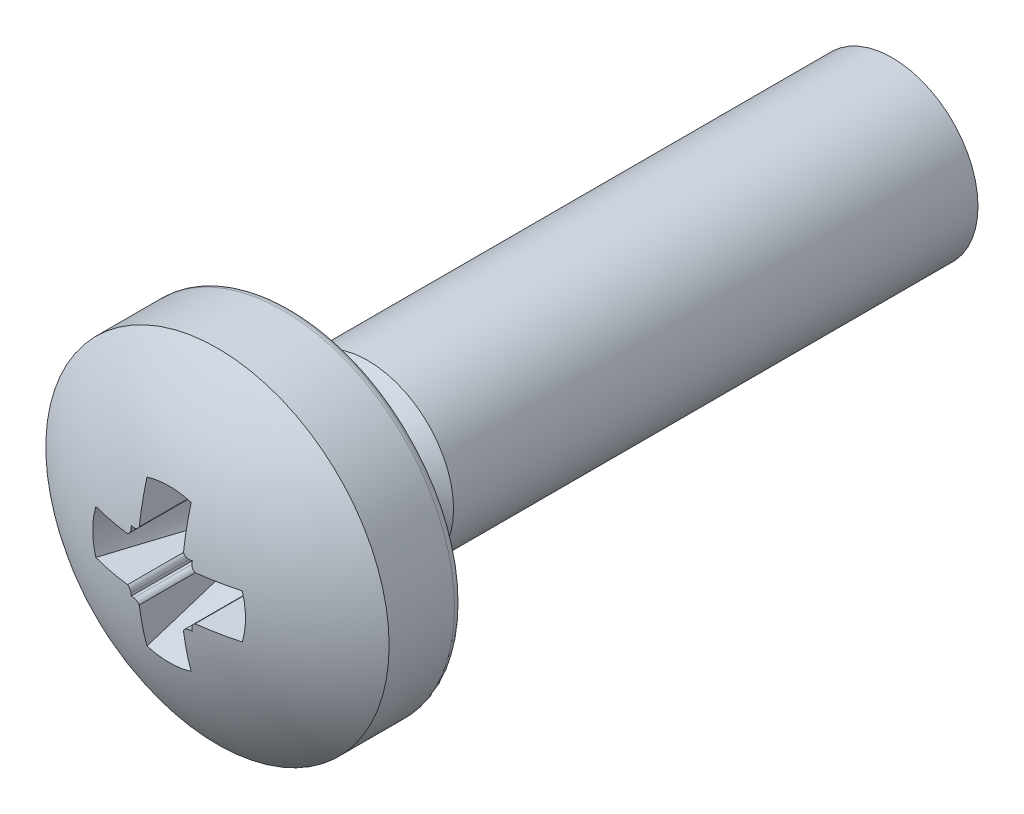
ISO-10303-21;
HEADER;
FILE_DESCRIPTION(('STEP AP214'),'2;1');
FILE_NAME('part.step','',(''),(''),'','','');
FILE_SCHEMA(('AUTOMOTIVE_DESIGN { 1 0 10303 214 1 1 1 1 }'));
ENDSEC;
DATA;
#1=APPLICATION_CONTEXT('core data for automotive mechanical design processes');
#2=APPLICATION_PROTOCOL_DEFINITION('international standard','automotive_design',2000,#1);
#3=PRODUCT_CONTEXT('',#1,'mechanical');
#4=PRODUCT('Part','Part','',(#3));
#5=PRODUCT_RELATED_PRODUCT_CATEGORY('part','',(#4));
#6=PRODUCT_DEFINITION_FORMATION('','',#4);
#7=PRODUCT_DEFINITION_CONTEXT('part definition',#1,'design');
#8=PRODUCT_DEFINITION('design','',#6,#7);
#9=PRODUCT_DEFINITION_SHAPE('','',#8);
#10=(LENGTH_UNIT() NAMED_UNIT(*) SI_UNIT(.MILLI.,.METRE.));
#11=(NAMED_UNIT(*) PLANE_ANGLE_UNIT() SI_UNIT($,.RADIAN.));
#12=(NAMED_UNIT(*) SI_UNIT($,.STERADIAN.) SOLID_ANGLE_UNIT());
#13=UNCERTAINTY_MEASURE_WITH_UNIT(LENGTH_MEASURE(1.E-05),#10,'distance_accuracy_value','');
#14=(GEOMETRIC_REPRESENTATION_CONTEXT(3) GLOBAL_UNCERTAINTY_ASSIGNED_CONTEXT((#13)) GLOBAL_UNIT_ASSIGNED_CONTEXT((#10,
#11,#12)) REPRESENTATION_CONTEXT('',''));
#15=CARTESIAN_POINT('',(0.,0.,0.));
#16=DIRECTION('',(0.,0.,1.));
#17=DIRECTION('',(1.,0.,0.));
#18=AXIS2_PLACEMENT_3D('',#15,#16,#17);
#19=CARTESIAN_POINT('',(0.,0.,-3.4));
#20=DIRECTION('',(1.,0.,0.));
#21=DIRECTION('',(0.,0.,-1.));
#22=AXIS2_PLACEMENT_3D('',#19,#20,#21);
#23=SPHERICAL_SURFACE('',#22,6.5);
#24=CARTESIAN_POINT('',(0.,0.,1.7234753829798));
#25=DIRECTION('',(0.,0.,1.));
#26=DIRECTION('',(1.,0.,0.));
#27=AXIS2_PLACEMENT_3D('',#24,#25,#26);
#28=CIRCLE('',#27,4.);
#29=CARTESIAN_POINT('',(4.,0.,1.7234753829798));
#30=VERTEX_POINT('',#29);
#31=EDGE_CURVE('E309',#30,#30,#28,.T.);
#32=ORIENTED_EDGE('',*,*,#31,.T.);
#33=EDGE_LOOP('',(#32));
#34=FACE_BOUND('',#33,.T.);
#35=CARTESIAN_POINT('',(0.0255182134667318,-0.730746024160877,-3.4));
#36=DIRECTION('',(-0.0348994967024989,0.999390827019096,0.));
#37=DIRECTION('',(0.999390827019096,0.0348994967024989,0.));
#38=AXIS2_PLACEMENT_3D('',#35,#36,#37);
#39=CIRCLE('',#38,6.45874283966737);
#40=CARTESIAN_POINT('',(0.641767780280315,-0.709226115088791,3.02924042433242));
#41=VERTEX_POINT('',#40);
#42=CARTESIAN_POINT('',(0.694396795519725,-0.707388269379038,3.02397189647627));
#43=VERTEX_POINT('',#42);
#44=EDGE_CURVE('E11',#41,#43,#39,.T.);
#45=ORIENTED_EDGE('',*,*,#44,.F.);
#46=CARTESIAN_POINT('',(0.641767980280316,-0.709226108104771,3.02924040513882));
#47=CARTESIAN_POINT('',(0.633441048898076,-0.709509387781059,3.03004051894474));
#48=CARTESIAN_POINT('',(0.6251303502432,-0.710501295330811,3.03074417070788));
#49=CARTESIAN_POINT('',(0.608780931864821,-0.713848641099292,3.03194179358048));
#50=CARTESIAN_POINT('',(0.600741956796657,-0.716202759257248,3.03243596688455));
#51=CARTESIAN_POINT('',(0.585153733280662,-0.7222233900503,3.03319971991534));
#52=CARTESIAN_POINT('',(0.577604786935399,-0.725890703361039,3.03346916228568));
#53=CARTESIAN_POINT('',(0.563216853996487,-0.734435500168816,3.03377504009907));
#54=CARTESIAN_POINT('',(0.556378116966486,-0.739313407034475,3.0338113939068));
#55=CARTESIAN_POINT('',(0.543637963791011,-0.750115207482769,3.03365016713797));
#56=CARTESIAN_POINT('',(0.537732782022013,-0.756034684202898,3.03345355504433));
#57=CARTESIAN_POINT('',(0.527000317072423,-0.768755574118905,3.032834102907));
#58=CARTESIAN_POINT('',(0.522170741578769,-0.775555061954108,3.03241175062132));
#59=CARTESIAN_POINT('',(0.516927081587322,-0.78440617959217,3.03175694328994));
#60=CARTESIAN_POINT('',(0.515945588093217,-0.786141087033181,3.03162393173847));
#61=CARTESIAN_POINT('',(0.514999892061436,-0.78789389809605,3.03148492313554));
#62=B_SPLINE_CURVE_WITH_KNOTS('',3,(#46,#47,#48,#49,#50,#51,#52,#53,#54,#55,#56,#57,#58,#59,#60,
#61),.UNSPECIFIED.,.F.,.F.,(4,2,2,2,2,2,2,4),(0.,0.0250792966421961,0.0501343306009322,
0.0752046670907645,0.10028378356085,0.125259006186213,0.150180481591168,0.156171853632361),.UNSPECIFIED.);
#63=CARTESIAN_POINT('',(0.515,-0.787893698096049,3.03148493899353));
#64=VERTEX_POINT('',#63);
#65=EDGE_CURVE('E900',#41,#64,#62,.T.);
#66=ORIENTED_EDGE('',*,*,#65,.T.);
#67=CARTESIAN_POINT('',(0.515,0.,-3.4));
#68=DIRECTION('',(1.,0.,0.));
#69=DIRECTION('',(0.,-1.,0.));
#70=AXIS2_PLACEMENT_3D('',#67,#68,#69);
#71=CIRCLE('',#70,6.47956595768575);
#72=CARTESIAN_POINT('',(0.515,-1.70562264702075,2.85105002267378));
#73=VERTEX_POINT('',#72);
#74=EDGE_CURVE('E944',#64,#73,#71,.T.);
#75=ORIENTED_EDGE('',*,*,#74,.T.);
#76=CARTESIAN_POINT('',(0.,0.,2.85105002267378));
#77=DIRECTION('',(0.,0.,-1.));
#78=DIRECTION('',(0.,1.,0.));
#79=AXIS2_PLACEMENT_3D('',#76,#77,#78);
#80=CIRCLE('',#79,1.78167719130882);
#81=CARTESIAN_POINT('',(-0.515,-1.70562264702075,2.85105002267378));
#82=VERTEX_POINT('',#81);
#83=EDGE_CURVE('E936',#73,#82,#80,.T.);
#84=ORIENTED_EDGE('',*,*,#83,.T.);
#85=CARTESIAN_POINT('',(-0.515,0.,-3.4));
#86=DIRECTION('',(1.,0.,0.));
#87=DIRECTION('',(0.,-1.,0.));
#88=AXIS2_PLACEMENT_3D('',#85,#86,#87);
#89=CIRCLE('',#88,6.47956595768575);
#90=CARTESIAN_POINT('',(-0.515,-0.78789369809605,3.03148493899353));
#91=VERTEX_POINT('',#90);
#92=EDGE_CURVE('E930',#91,#82,#89,.T.);
#93=ORIENTED_EDGE('',*,*,#92,.F.);
#94=CARTESIAN_POINT('',(-0.641767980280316,-0.709226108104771,3.02924040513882));
#95=CARTESIAN_POINT('',(-0.633441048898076,-0.709509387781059,3.03004051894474));
#96=CARTESIAN_POINT('',(-0.6251303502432,-0.710501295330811,3.03074417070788));
#97=CARTESIAN_POINT('',(-0.608780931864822,-0.713848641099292,3.03194179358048));
#98=CARTESIAN_POINT('',(-0.600741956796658,-0.716202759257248,3.03243596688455));
#99=CARTESIAN_POINT('',(-0.585153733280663,-0.7222233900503,3.03319971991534));
#100=CARTESIAN_POINT('',(-0.5776047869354,-0.725890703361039,3.03346916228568));
#101=CARTESIAN_POINT('',(-0.563216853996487,-0.734435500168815,3.03377504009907));
#102=CARTESIAN_POINT('',(-0.556378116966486,-0.739313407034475,3.0338113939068));
#103=CARTESIAN_POINT('',(-0.543637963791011,-0.750115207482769,3.03365016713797));
#104=CARTESIAN_POINT('',(-0.537732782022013,-0.756034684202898,3.03345355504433));
#105=CARTESIAN_POINT('',(-0.527000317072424,-0.768755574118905,3.032834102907));
#106=CARTESIAN_POINT('',(-0.52217074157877,-0.775555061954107,3.03241175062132));
#107=CARTESIAN_POINT('',(-0.516927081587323,-0.784406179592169,3.03175694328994));
#108=CARTESIAN_POINT('',(-0.515945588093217,-0.786141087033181,3.03162393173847));
#109=CARTESIAN_POINT('',(-0.514999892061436,-0.787893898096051,3.03148492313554));
#110=B_SPLINE_CURVE_WITH_KNOTS('',3,(#94,#95,#96,#97,#98,#99,#100,#101,#102,#103,#104,#105,#106,
#107,#108,#109),.UNSPECIFIED.,.F.,.F.,(4,2,2,2,2,2,2,4),(0.,0.0250792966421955,
0.0501343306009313,0.0752046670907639,0.10028378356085,0.125259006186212,0.150180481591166,
0.156171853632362),.UNSPECIFIED.);
#111=CARTESIAN_POINT('',(-0.641767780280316,-0.709226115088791,3.02924042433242));
#112=VERTEX_POINT('',#111);
#113=EDGE_CURVE('E924',#112,#91,#110,.T.);
#114=ORIENTED_EDGE('',*,*,#113,.F.);
#115=CARTESIAN_POINT('',(-0.0255182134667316,-0.730746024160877,-3.4));
#116=DIRECTION('',(-0.0348994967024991,-0.999390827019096,0.));
#117=DIRECTION('',(-0.999390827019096,0.0348994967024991,0.));
#118=AXIS2_PLACEMENT_3D('',#115,#116,#117);
#119=CIRCLE('',#118,6.45874283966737);
#120=CARTESIAN_POINT('',(-0.694396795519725,-0.707388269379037,3.02397189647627));
#121=VERTEX_POINT('',#120);
#122=EDGE_CURVE('E931',#112,#121,#119,.T.);
#123=ORIENTED_EDGE('',*,*,#122,.T.);
#124=CARTESIAN_POINT('',(-2.18973872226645,2.18973872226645,-1.02377385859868));
#125=DIRECTION('',(-0.560985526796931,0.560985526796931,0.608761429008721));
#126=DIRECTION('',(0.,-0.735373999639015,0.677661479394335));
#127=AXIS2_PLACEMENT_3D('',#124,#125,#126);
#128=CIRCLE('',#127,5.19746457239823);
#129=CARTESIAN_POINT('',(-0.707945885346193,-0.718048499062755,3.02130975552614));
#130=VERTEX_POINT('',#129);
#131=EDGE_CURVE('E970',#130,#121,#128,.T.);
#132=ORIENTED_EDGE('',*,*,#131,.F.);
#133=CARTESIAN_POINT('',(0.441436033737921,0.441436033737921,2.85845537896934));
#134=DIRECTION('',(0.0701860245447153,0.0701860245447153,0.995061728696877));
#135=DIRECTION('',(0.9975216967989,0.,-0.0703595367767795));
#136=AXIS2_PLACEMENT_3D('',#133,#134,#135);
#137=CIRCLE('',#136,1.64073298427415);
#138=CARTESIAN_POINT('',(-0.718048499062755,-0.707945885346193,3.02130975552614));
#139=VERTEX_POINT('',#138);
#140=EDGE_CURVE('E967',#139,#130,#137,.T.);
#141=ORIENTED_EDGE('',*,*,#140,.F.);
#142=CARTESIAN_POINT('',(2.18973872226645,-2.18973872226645,-1.02377385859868));
#143=DIRECTION('',(-0.560985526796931,0.560985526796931,-0.608761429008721));
#144=DIRECTION('',(-0.735373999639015,0.,0.677661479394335));
#145=AXIS2_PLACEMENT_3D('',#142,#143,#144);
#146=CIRCLE('',#145,5.19746457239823);
#147=CARTESIAN_POINT('',(-0.707388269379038,-0.694396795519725,3.02397189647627));
#148=VERTEX_POINT('',#147);
#149=EDGE_CURVE('E968',#139,#148,#146,.T.);
#150=ORIENTED_EDGE('',*,*,#149,.T.);
#151=CARTESIAN_POINT('',(-0.730746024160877,-0.0255182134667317,-3.4));
#152=DIRECTION('',(0.999390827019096,0.0348994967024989,0.));
#153=DIRECTION('',(0.0348994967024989,-0.999390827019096,0.));
#154=AXIS2_PLACEMENT_3D('',#151,#152,#153);
#155=CIRCLE('',#154,6.45874283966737);
#156=CARTESIAN_POINT('',(-0.709226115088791,-0.641767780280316,3.02924042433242));
#157=VERTEX_POINT('',#156);
#158=EDGE_CURVE('E584',#157,#148,#155,.T.);
#159=ORIENTED_EDGE('',*,*,#158,.F.);
#160=CARTESIAN_POINT('',(-0.709226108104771,-0.641767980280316,3.02924040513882));
#161=CARTESIAN_POINT('',(-0.709509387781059,-0.633441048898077,3.03004051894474));
#162=CARTESIAN_POINT('',(-0.710501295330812,-0.625130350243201,3.03074417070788));
#163=CARTESIAN_POINT('',(-0.713848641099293,-0.608780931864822,3.03194179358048));
#164=CARTESIAN_POINT('',(-0.716202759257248,-0.600741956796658,3.03243596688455));
#165=CARTESIAN_POINT('',(-0.7222233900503,-0.585153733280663,3.03319971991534));
#166=CARTESIAN_POINT('',(-0.72589070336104,-0.5776047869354,3.03346916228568));
#167=CARTESIAN_POINT('',(-0.734435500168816,-0.563216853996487,3.03377504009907));
#168=CARTESIAN_POINT('',(-0.739313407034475,-0.556378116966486,3.0338113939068));
#169=CARTESIAN_POINT('',(-0.750115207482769,-0.543637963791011,3.03365016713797));
#170=CARTESIAN_POINT('',(-0.756034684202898,-0.537732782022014,3.03345355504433));
#171=CARTESIAN_POINT('',(-0.768755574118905,-0.527000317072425,3.032834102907));
#172=CARTESIAN_POINT('',(-0.775555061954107,-0.522170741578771,3.03241175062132));
#173=CARTESIAN_POINT('',(-0.784406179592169,-0.516927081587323,3.03175694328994));
#174=CARTESIAN_POINT('',(-0.786141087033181,-0.515945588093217,3.03162393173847));
#175=CARTESIAN_POINT('',(-0.78789389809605,-0.514999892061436,3.03148492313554));
#176=B_SPLINE_CURVE_WITH_KNOTS('',3,(#160,#161,#162,#163,#164,#165,#166,#167,#168,#169,#170,
#171,#172,#173,#174,#175),.UNSPECIFIED.,.F.,.F.,(4,2,2,2,2,2,2,4),(0.,0.0250792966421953,
0.0501343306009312,0.075204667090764,0.10028378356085,0.125259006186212,0.150180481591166,
0.156171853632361),.UNSPECIFIED.);
#177=CARTESIAN_POINT('',(-0.78789369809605,-0.515,3.03148493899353));
#178=VERTEX_POINT('',#177);
#179=EDGE_CURVE('E578',#157,#178,#176,.T.);
#180=ORIENTED_EDGE('',*,*,#179,.T.);
#181=CARTESIAN_POINT('',(0.,-0.515,-3.4));
#182=DIRECTION('',(0.,1.,0.));
#183=DIRECTION('',(1.,0.,0.));
#184=AXIS2_PLACEMENT_3D('',#181,#182,#183);
#185=CIRCLE('',#184,6.47956595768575);
#186=CARTESIAN_POINT('',(-1.70562264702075,-0.515,2.85105002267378));
#187=VERTEX_POINT('',#186);
#188=EDGE_CURVE('E569',#187,#178,#185,.T.);
#189=ORIENTED_EDGE('',*,*,#188,.F.);
#190=CARTESIAN_POINT('',(0.,0.,2.85105002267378));
#191=DIRECTION('',(0.,0.,-1.));
#192=DIRECTION('',(0.,1.,0.));
#193=AXIS2_PLACEMENT_3D('',#190,#191,#192);
#194=CIRCLE('',#193,1.78167719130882);
#195=CARTESIAN_POINT('',(-1.70562264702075,0.515,2.85105002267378));
#196=VERTEX_POINT('',#195);
#197=EDGE_CURVE('E563',#187,#196,#194,.T.);
#198=ORIENTED_EDGE('',*,*,#197,.T.);
#199=CARTESIAN_POINT('',(0.,0.515,-3.4));
#200=DIRECTION('',(0.,1.,0.));
#201=DIRECTION('',(1.,0.,0.));
#202=AXIS2_PLACEMENT_3D('',#199,#200,#201);
#203=CIRCLE('',#202,6.47956595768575);
#204=CARTESIAN_POINT('',(-0.78789369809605,0.515,3.03148493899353));
#205=VERTEX_POINT('',#204);
#206=EDGE_CURVE('E610',#196,#205,#203,.T.);
#207=ORIENTED_EDGE('',*,*,#206,.T.);
#208=CARTESIAN_POINT('',(-0.709226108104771,0.641767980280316,3.02924040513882));
#209=CARTESIAN_POINT('',(-0.70950938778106,0.633441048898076,3.03004051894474));
#210=CARTESIAN_POINT('',(-0.710501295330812,0.6251303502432,3.03074417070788));
#211=CARTESIAN_POINT('',(-0.713848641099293,0.608780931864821,3.03194179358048));
#212=CARTESIAN_POINT('',(-0.716202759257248,0.600741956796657,3.03243596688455));
#213=CARTESIAN_POINT('',(-0.7222233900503,0.585153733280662,3.03319971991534));
#214=CARTESIAN_POINT('',(-0.72589070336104,0.577604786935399,3.03346916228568));
#215=CARTESIAN_POINT('',(-0.734435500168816,0.563216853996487,3.03377504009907));
#216=CARTESIAN_POINT('',(-0.739313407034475,0.556378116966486,3.0338113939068));
#217=CARTESIAN_POINT('',(-0.750115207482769,0.543637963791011,3.03365016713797));
#218=CARTESIAN_POINT('',(-0.756034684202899,0.537732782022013,3.03345355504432));
#219=CARTESIAN_POINT('',(-0.768755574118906,0.527000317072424,3.032834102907));
#220=CARTESIAN_POINT('',(-0.775555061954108,0.522170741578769,3.03241175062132));
#221=CARTESIAN_POINT('',(-0.78440617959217,0.516927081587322,3.03175694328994));
#222=CARTESIAN_POINT('',(-0.786141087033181,0.515945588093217,3.03162393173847));
#223=CARTESIAN_POINT('',(-0.78789389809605,0.514999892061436,3.03148492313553));
#224=B_SPLINE_CURVE_WITH_KNOTS('',3,(#208,#209,#210,#211,#212,#213,#214,#215,#216,#217,#218,
#219,#220,#221,#222,#223),.UNSPECIFIED.,.F.,.F.,(4,2,2,2,2,2,2,4),(0.,0.0250792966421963,
0.0501343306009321,0.0752046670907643,0.10028378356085,0.125259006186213,0.150180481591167,
0.156171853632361),.UNSPECIFIED.);
#225=CARTESIAN_POINT('',(-0.709226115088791,0.641767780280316,3.02924042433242));
#226=VERTEX_POINT('',#225);
#227=EDGE_CURVE('E602',#226,#205,#224,.T.);
#228=ORIENTED_EDGE('',*,*,#227,.F.);
#229=CARTESIAN_POINT('',(-0.730746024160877,0.0255182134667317,-3.4));
#230=DIRECTION('',(-0.999390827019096,0.0348994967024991,0.));
#231=DIRECTION('',(0.0348994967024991,0.999390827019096,0.));
#232=AXIS2_PLACEMENT_3D('',#229,#230,#231);
#233=CIRCLE('',#232,6.45874283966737);
#234=CARTESIAN_POINT('',(-0.707388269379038,0.694396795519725,3.02397189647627));
#235=VERTEX_POINT('',#234);
#236=EDGE_CURVE('E40',#226,#235,#233,.T.);
#237=ORIENTED_EDGE('',*,*,#236,.T.);
#238=CARTESIAN_POINT('',(2.18973872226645,2.18973872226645,-1.02377385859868));
#239=DIRECTION('',(0.560985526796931,0.560985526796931,0.608761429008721));
#240=DIRECTION('',(0.735373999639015,0.,-0.677661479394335));
#241=AXIS2_PLACEMENT_3D('',#238,#239,#240);
#242=CIRCLE('',#241,5.19746457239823);
#243=CARTESIAN_POINT('',(-0.718048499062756,0.707945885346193,3.02130975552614));
#244=VERTEX_POINT('',#243);
#245=EDGE_CURVE('E344',#244,#235,#242,.T.);
#246=ORIENTED_EDGE('',*,*,#245,.F.);
#247=CARTESIAN_POINT('',(0.44143603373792,-0.44143603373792,2.85845537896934));
#248=DIRECTION('',(0.0701860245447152,-0.0701860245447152,0.995061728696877));
#249=DIRECTION('',(0.9975216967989,0.,-0.0703595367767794));
#250=AXIS2_PLACEMENT_3D('',#247,#248,#249);
#251=CIRCLE('',#250,1.64073298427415);
#252=CARTESIAN_POINT('',(-0.707945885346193,0.718048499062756,3.02130975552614));
#253=VERTEX_POINT('',#252);
#254=EDGE_CURVE('E339',#253,#244,#251,.T.);
#255=ORIENTED_EDGE('',*,*,#254,.F.);
#256=CARTESIAN_POINT('',(-2.18973872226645,-2.18973872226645,-1.02377385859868));
#257=DIRECTION('',(0.560985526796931,0.560985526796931,-0.608761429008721));
#258=DIRECTION('',(-0.735373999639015,0.,-0.677661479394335));
#259=AXIS2_PLACEMENT_3D('',#256,#257,#258);
#260=CIRCLE('',#259,5.19746457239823);
#261=CARTESIAN_POINT('',(-0.694396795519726,0.707388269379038,3.02397189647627));
#262=VERTEX_POINT('',#261);
#263=EDGE_CURVE('E341',#253,#262,#260,.T.);
#264=ORIENTED_EDGE('',*,*,#263,.T.);
#265=CARTESIAN_POINT('',(-0.0255182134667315,0.730746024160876,-3.4));
#266=DIRECTION('',(0.034899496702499,-0.999390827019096,0.));
#267=DIRECTION('',(-0.999390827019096,-0.034899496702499,0.));
#268=AXIS2_PLACEMENT_3D('',#265,#266,#267);
#269=CIRCLE('',#268,6.45874283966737);
#270=CARTESIAN_POINT('',(-0.641767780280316,0.709226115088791,3.02924042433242));
#271=VERTEX_POINT('',#270);
#272=EDGE_CURVE('E346',#271,#262,#269,.T.);
#273=ORIENTED_EDGE('',*,*,#272,.F.);
#274=CARTESIAN_POINT('',(-0.641767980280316,0.709226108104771,3.02924040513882));
#275=CARTESIAN_POINT('',(-0.633441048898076,0.709509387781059,3.03004051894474));
#276=CARTESIAN_POINT('',(-0.6251303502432,0.710501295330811,3.03074417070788));
#277=CARTESIAN_POINT('',(-0.608780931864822,0.713848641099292,3.03194179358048));
#278=CARTESIAN_POINT('',(-0.600741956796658,0.716202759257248,3.03243596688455));
#279=CARTESIAN_POINT('',(-0.585153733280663,0.7222233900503,3.03319971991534));
#280=CARTESIAN_POINT('',(-0.5776047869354,0.725890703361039,3.03346916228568));
#281=CARTESIAN_POINT('',(-0.563216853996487,0.734435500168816,3.03377504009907));
#282=CARTESIAN_POINT('',(-0.556378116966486,0.739313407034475,3.0338113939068));
#283=CARTESIAN_POINT('',(-0.543637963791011,0.750115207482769,3.03365016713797));
#284=CARTESIAN_POINT('',(-0.537732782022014,0.756034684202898,3.03345355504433));
#285=CARTESIAN_POINT('',(-0.527000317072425,0.768755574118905,3.032834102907));
#286=CARTESIAN_POINT('',(-0.52217074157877,0.775555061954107,3.03241175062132));
#287=CARTESIAN_POINT('',(-0.516927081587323,0.784406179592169,3.03175694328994));
#288=CARTESIAN_POINT('',(-0.515945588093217,0.786141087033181,3.03162393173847));
#289=CARTESIAN_POINT('',(-0.514999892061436,0.787893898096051,3.03148492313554));
#290=B_SPLINE_CURVE_WITH_KNOTS('',3,(#274,#275,#276,#277,#278,#279,#280,#281,#282,#283,#284,
#285,#286,#287,#288,#289),.UNSPECIFIED.,.F.,.F.,(4,2,2,2,2,2,2,4),(0.,0.0250792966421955,
0.0501343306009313,0.075204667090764,0.10028378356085,0.125259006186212,0.150180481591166,
0.156171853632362),.UNSPECIFIED.);
#291=CARTESIAN_POINT('',(-0.515,0.787893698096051,3.03148493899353));
#292=VERTEX_POINT('',#291);
#293=EDGE_CURVE('E348',#271,#292,#290,.T.);
#294=ORIENTED_EDGE('',*,*,#293,.T.);
#295=CARTESIAN_POINT('',(-0.515,0.,-3.4));
#296=DIRECTION('',(1.,0.,0.));
#297=DIRECTION('',(0.,0.,-1.));
#298=AXIS2_PLACEMENT_3D('',#295,#296,#297);
#299=CIRCLE('',#298,6.47956595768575);
#300=CARTESIAN_POINT('',(-0.515,1.70562264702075,2.85105002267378));
#301=VERTEX_POINT('',#300);
#302=EDGE_CURVE('E355',#301,#292,#299,.T.);
#303=ORIENTED_EDGE('',*,*,#302,.F.);
#304=CARTESIAN_POINT('',(0.,0.,2.85105002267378));
#305=DIRECTION('',(0.,0.,-1.));
#306=DIRECTION('',(0.,1.,0.));
#307=AXIS2_PLACEMENT_3D('',#304,#305,#306);
#308=CIRCLE('',#307,1.78167719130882);
#309=CARTESIAN_POINT('',(0.515,1.70562264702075,2.85105002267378));
#310=VERTEX_POINT('',#309);
#311=EDGE_CURVE('E1076',#301,#310,#308,.T.);
#312=ORIENTED_EDGE('',*,*,#311,.T.);
#313=CARTESIAN_POINT('',(0.515,0.,-3.4));
#314=DIRECTION('',(1.,0.,0.));
#315=DIRECTION('',(0.,0.,-1.));
#316=AXIS2_PLACEMENT_3D('',#313,#314,#315);
#317=CIRCLE('',#316,6.47956595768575);
#318=CARTESIAN_POINT('',(0.515,0.787893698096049,3.03148493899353));
#319=VERTEX_POINT('',#318);
#320=EDGE_CURVE('E608',#310,#319,#317,.T.);
#321=ORIENTED_EDGE('',*,*,#320,.T.);
#322=CARTESIAN_POINT('',(0.641767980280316,0.709226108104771,3.02924040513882));
#323=CARTESIAN_POINT('',(0.633441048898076,0.709509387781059,3.03004051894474));
#324=CARTESIAN_POINT('',(0.6251303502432,0.710501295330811,3.03074417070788));
#325=CARTESIAN_POINT('',(0.608780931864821,0.713848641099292,3.03194179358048));
#326=CARTESIAN_POINT('',(0.600741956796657,0.716202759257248,3.03243596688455));
#327=CARTESIAN_POINT('',(0.585153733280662,0.7222233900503,3.03319971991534));
#328=CARTESIAN_POINT('',(0.577604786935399,0.725890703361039,3.03346916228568));
#329=CARTESIAN_POINT('',(0.563216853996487,0.734435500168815,3.03377504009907));
#330=CARTESIAN_POINT('',(0.556378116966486,0.739313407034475,3.0338113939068));
#331=CARTESIAN_POINT('',(0.543637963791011,0.750115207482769,3.03365016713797));
#332=CARTESIAN_POINT('',(0.537732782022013,0.756034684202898,3.03345355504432));
#333=CARTESIAN_POINT('',(0.527000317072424,0.768755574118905,3.032834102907));
#334=CARTESIAN_POINT('',(0.522170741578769,0.775555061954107,3.03241175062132));
#335=CARTESIAN_POINT('',(0.516927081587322,0.784406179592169,3.03175694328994));
#336=CARTESIAN_POINT('',(0.515945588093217,0.78614108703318,3.03162393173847));
#337=CARTESIAN_POINT('',(0.514999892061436,0.787893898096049,3.03148492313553));
#338=B_SPLINE_CURVE_WITH_KNOTS('',3,(#322,#323,#324,#325,#326,#327,#328,#329,#330,#331,#332,
#333,#334,#335,#336,#337),.UNSPECIFIED.,.F.,.F.,(4,2,2,2,2,2,2,4),(0.,0.0250792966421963,
0.0501343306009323,0.0752046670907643,0.10028378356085,0.125259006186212,0.150180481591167,
0.156171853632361),.UNSPECIFIED.);
#339=CARTESIAN_POINT('',(0.641767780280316,0.709226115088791,3.02924042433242));
#340=VERTEX_POINT('',#339);
#341=EDGE_CURVE('E556',#340,#319,#338,.T.);
#342=ORIENTED_EDGE('',*,*,#341,.F.);
#343=CARTESIAN_POINT('',(0.0255182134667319,0.730746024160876,-3.4));
#344=DIRECTION('',(0.034899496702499,0.999390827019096,0.));
#345=DIRECTION('',(0.999390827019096,-0.034899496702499,0.));
#346=AXIS2_PLACEMENT_3D('',#343,#344,#345);
#347=CIRCLE('',#346,6.45874283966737);
#348=CARTESIAN_POINT('',(0.694396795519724,0.707388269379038,3.02397189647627));
#349=VERTEX_POINT('',#348);
#350=EDGE_CURVE('E562',#340,#349,#347,.T.);
#351=ORIENTED_EDGE('',*,*,#350,.T.);
#352=CARTESIAN_POINT('',(2.18973872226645,-2.18973872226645,-1.02377385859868));
#353=DIRECTION('',(0.560985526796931,-0.560985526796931,0.608761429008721));
#354=DIRECTION('',(0.,-0.735373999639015,-0.677661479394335));
#355=AXIS2_PLACEMENT_3D('',#352,#353,#354);
#356=CIRCLE('',#355,5.19746457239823);
#357=CARTESIAN_POINT('',(0.707945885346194,0.718048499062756,3.02130975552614));
#358=VERTEX_POINT('',#357);
#359=EDGE_CURVE('E567',#358,#349,#356,.T.);
#360=ORIENTED_EDGE('',*,*,#359,.F.);
#361=CARTESIAN_POINT('',(-0.44143603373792,-0.441436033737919,2.85845537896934));
#362=DIRECTION('',(-0.0701860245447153,-0.0701860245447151,0.995061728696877));
#363=DIRECTION('',(0.9975216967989,0.,0.0703595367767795));
#364=AXIS2_PLACEMENT_3D('',#361,#362,#363);
#365=CIRCLE('',#364,1.64073298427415);
#366=CARTESIAN_POINT('',(0.718048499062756,0.707945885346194,3.02130975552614));
#367=VERTEX_POINT('',#366);
#368=EDGE_CURVE('E571',#367,#358,#365,.T.);
#369=ORIENTED_EDGE('',*,*,#368,.F.);
#370=CARTESIAN_POINT('',(-2.18973872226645,2.18973872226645,-1.02377385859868));
#371=DIRECTION('',(0.560985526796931,-0.560985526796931,-0.608761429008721));
#372=DIRECTION('',(0.,0.735373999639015,-0.677661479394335));
#373=AXIS2_PLACEMENT_3D('',#370,#371,#372);
#374=CIRCLE('',#373,5.19746457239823);
#375=CARTESIAN_POINT('',(0.707388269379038,0.694396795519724,3.02397189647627));
#376=VERTEX_POINT('',#375);
#377=EDGE_CURVE('E573',#367,#376,#374,.T.);
#378=ORIENTED_EDGE('',*,*,#377,.T.);
#379=CARTESIAN_POINT('',(0.730746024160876,0.0255182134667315,-3.4));
#380=DIRECTION('',(-0.999390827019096,-0.0348994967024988,0.));
#381=DIRECTION('',(-0.0348994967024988,0.999390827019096,0.));
#382=AXIS2_PLACEMENT_3D('',#379,#380,#381);
#383=CIRCLE('',#382,6.45874283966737);
#384=CARTESIAN_POINT('',(0.709226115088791,0.641767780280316,3.02924042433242));
#385=VERTEX_POINT('',#384);
#386=EDGE_CURVE('E576',#385,#376,#383,.T.);
#387=ORIENTED_EDGE('',*,*,#386,.F.);
#388=CARTESIAN_POINT('',(0.709226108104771,0.641767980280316,3.02924040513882));
#389=CARTESIAN_POINT('',(0.709509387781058,0.633441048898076,3.03004051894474));
#390=CARTESIAN_POINT('',(0.710501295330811,0.6251303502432,3.03074417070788));
#391=CARTESIAN_POINT('',(0.713848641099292,0.608780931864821,3.03194179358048));
#392=CARTESIAN_POINT('',(0.716202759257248,0.600741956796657,3.03243596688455));
#393=CARTESIAN_POINT('',(0.7222233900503,0.585153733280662,3.03319971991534));
#394=CARTESIAN_POINT('',(0.725890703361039,0.577604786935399,3.03346916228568));
#395=CARTESIAN_POINT('',(0.734435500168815,0.563216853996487,3.03377504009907));
#396=CARTESIAN_POINT('',(0.739313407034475,0.556378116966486,3.0338113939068));
#397=CARTESIAN_POINT('',(0.750115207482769,0.543637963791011,3.03365016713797));
#398=CARTESIAN_POINT('',(0.756034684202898,0.537732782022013,3.03345355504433));
#399=CARTESIAN_POINT('',(0.768755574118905,0.527000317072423,3.032834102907));
#400=CARTESIAN_POINT('',(0.775555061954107,0.522170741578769,3.03241175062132));
#401=CARTESIAN_POINT('',(0.784406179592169,0.516927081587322,3.03175694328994));
#402=CARTESIAN_POINT('',(0.786141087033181,0.515945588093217,3.03162393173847));
#403=CARTESIAN_POINT('',(0.78789389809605,0.514999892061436,3.03148492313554));
#404=B_SPLINE_CURVE_WITH_KNOTS('',3,(#388,#389,#390,#391,#392,#393,#394,#395,#396,#397,#398,
#399,#400,#401,#402,#403),.UNSPECIFIED.,.F.,.F.,(4,2,2,2,2,2,2,4),(0.,0.0250792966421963,
0.0501343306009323,0.0752046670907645,0.10028378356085,0.125259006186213,0.150180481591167,
0.156171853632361),.UNSPECIFIED.);
#405=CARTESIAN_POINT('',(0.78789369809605,0.515,3.03148493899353));
#406=VERTEX_POINT('',#405);
#407=EDGE_CURVE('E961',#385,#406,#404,.T.);
#408=ORIENTED_EDGE('',*,*,#407,.T.);
#409=CARTESIAN_POINT('',(0.,0.515,-3.4));
#410=DIRECTION('',(0.,1.,0.));
#411=DIRECTION('',(1.,0.,0.));
#412=AXIS2_PLACEMENT_3D('',#409,#410,#411);
#413=CIRCLE('',#412,6.47956595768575);
#414=CARTESIAN_POINT('',(1.70562264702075,0.515,2.85105002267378));
#415=VERTEX_POINT('',#414);
#416=EDGE_CURVE('E972',#406,#415,#413,.T.);
#417=ORIENTED_EDGE('',*,*,#416,.T.);
#418=CARTESIAN_POINT('',(0.,0.,2.85105002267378));
#419=DIRECTION('',(0.,0.,-1.));
#420=DIRECTION('',(0.,1.,0.));
#421=AXIS2_PLACEMENT_3D('',#418,#419,#420);
#422=CIRCLE('',#421,1.78167719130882);
#423=CARTESIAN_POINT('',(1.70562264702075,-0.515,2.85105002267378));
#424=VERTEX_POINT('',#423);
#425=EDGE_CURVE('E974',#415,#424,#422,.T.);
#426=ORIENTED_EDGE('',*,*,#425,.T.);
#427=CARTESIAN_POINT('',(0.,-0.515,-3.4));
#428=DIRECTION('',(0.,1.,0.));
#429=DIRECTION('',(1.,0.,0.));
#430=AXIS2_PLACEMENT_3D('',#427,#428,#429);
#431=CIRCLE('',#430,6.47956595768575);
#432=CARTESIAN_POINT('',(0.787893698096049,-0.515,3.03148493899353));
#433=VERTEX_POINT('',#432);
#434=EDGE_CURVE('E934',#433,#424,#431,.T.);
#435=ORIENTED_EDGE('',*,*,#434,.F.);
#436=CARTESIAN_POINT('',(0.70922610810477,-0.641767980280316,3.02924040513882));
#437=CARTESIAN_POINT('',(0.709509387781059,-0.633441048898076,3.03004051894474));
#438=CARTESIAN_POINT('',(0.710501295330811,-0.6251303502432,3.03074417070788));
#439=CARTESIAN_POINT('',(0.713848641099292,-0.608780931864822,3.03194179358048));
#440=CARTESIAN_POINT('',(0.716202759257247,-0.600741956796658,3.03243596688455));
#441=CARTESIAN_POINT('',(0.722223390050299,-0.585153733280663,3.03319971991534));
#442=CARTESIAN_POINT('',(0.725890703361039,-0.5776047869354,3.03346916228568));
#443=CARTESIAN_POINT('',(0.734435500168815,-0.563216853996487,3.03377504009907));
#444=CARTESIAN_POINT('',(0.739313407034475,-0.556378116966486,3.0338113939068));
#445=CARTESIAN_POINT('',(0.750115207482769,-0.543637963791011,3.03365016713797));
#446=CARTESIAN_POINT('',(0.756034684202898,-0.537732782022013,3.03345355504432));
#447=CARTESIAN_POINT('',(0.768755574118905,-0.527000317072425,3.032834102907));
#448=CARTESIAN_POINT('',(0.775555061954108,-0.522170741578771,3.03241175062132));
#449=CARTESIAN_POINT('',(0.784406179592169,-0.516927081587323,3.03175694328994));
#450=CARTESIAN_POINT('',(0.78614108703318,-0.515945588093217,3.03162393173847));
#451=CARTESIAN_POINT('',(0.787893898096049,-0.514999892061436,3.03148492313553));
#452=B_SPLINE_CURVE_WITH_KNOTS('',3,(#436,#437,#438,#439,#440,#441,#442,#443,#444,#445,#446,
#447,#448,#449,#450,#451),.UNSPECIFIED.,.F.,.F.,(4,2,2,2,2,2,2,4),(0.,0.0250792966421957,
0.0501343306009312,0.0752046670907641,0.10028378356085,0.125259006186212,0.150180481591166,
0.156171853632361),.UNSPECIFIED.);
#453=CARTESIAN_POINT('',(0.709226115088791,-0.641767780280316,3.02924042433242));
#454=VERTEX_POINT('',#453);
#455=EDGE_CURVE('E939',#454,#433,#452,.T.);
#456=ORIENTED_EDGE('',*,*,#455,.F.);
#457=CARTESIAN_POINT('',(0.730746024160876,-0.0255182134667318,-3.4));
#458=DIRECTION('',(0.999390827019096,-0.0348994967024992,0.));
#459=DIRECTION('',(-0.0348994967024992,-0.999390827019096,0.));
#460=AXIS2_PLACEMENT_3D('',#457,#458,#459);
#461=CIRCLE('',#460,6.45874283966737);
#462=CARTESIAN_POINT('',(0.707388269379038,-0.694396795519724,3.02397189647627));
#463=VERTEX_POINT('',#462);
#464=EDGE_CURVE('E1117',#454,#463,#461,.T.);
#465=ORIENTED_EDGE('',*,*,#464,.T.);
#466=CARTESIAN_POINT('',(-2.18973872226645,-2.18973872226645,-1.02377385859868));
#467=DIRECTION('',(-0.560985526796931,-0.560985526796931,0.608761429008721));
#468=DIRECTION('',(0.735373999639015,0.,0.677661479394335));
#469=AXIS2_PLACEMENT_3D('',#466,#467,#468);
#470=CIRCLE('',#469,5.19746457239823);
#471=CARTESIAN_POINT('',(0.718048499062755,-0.707945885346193,3.02130975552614));
#472=VERTEX_POINT('',#471);
#473=EDGE_CURVE('E907',#472,#463,#470,.T.);
#474=ORIENTED_EDGE('',*,*,#473,.F.);
#475=CARTESIAN_POINT('',(-0.44143603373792,0.441436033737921,2.85845537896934));
#476=DIRECTION('',(-0.0701860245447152,0.0701860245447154,0.995061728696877));
#477=DIRECTION('',(0.,-0.9975216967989,0.0703595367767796));
#478=AXIS2_PLACEMENT_3D('',#475,#476,#477);
#479=CIRCLE('',#478,1.64073298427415);
#480=CARTESIAN_POINT('',(0.707945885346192,-0.718048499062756,3.02130975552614));
#481=VERTEX_POINT('',#480);
#482=EDGE_CURVE('E899',#481,#472,#479,.T.);
#483=ORIENTED_EDGE('',*,*,#482,.F.);
#484=CARTESIAN_POINT('',(2.18973872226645,2.18973872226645,-1.02377385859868));
#485=DIRECTION('',(-0.560985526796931,-0.560985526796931,-0.608761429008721));
#486=DIRECTION('',(0.,0.735373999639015,-0.677661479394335));
#487=AXIS2_PLACEMENT_3D('',#484,#485,#486);
#488=CIRCLE('',#487,5.19746457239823);
#489=EDGE_CURVE('E25',#481,#43,#488,.T.);
#490=ORIENTED_EDGE('',*,*,#489,.T.);
#491=EDGE_LOOP('',(#45,#66,#75,#84,#93,#114,#123,#132,#141,#150,#159,#180,#189,#198,#207,#228,
#237,#246,#255,#264,#273,#294,#303,#312,#321,#342,#351,#360,#369,#378,#387,#408,#417,#426,#435,
#456,#465,#474,#483,#490));
#492=FACE_BOUND('',#491,.T.);
#493=ADVANCED_FACE('F17',(#34,#492),#23,.T.);
#494=CARTESIAN_POINT('',(0.,0.,-14.));
#495=DIRECTION('',(0.,0.,1.));
#496=DIRECTION('',(1.,0.,0.));
#497=AXIS2_PLACEMENT_3D('',#494,#495,#496);
#498=PLANE('',#497);
#499=CARTESIAN_POINT('',(0.,0.,-14.));
#500=DIRECTION('',(0.,0.,1.));
#501=DIRECTION('',(1.,0.,0.));
#502=AXIS2_PLACEMENT_3D('',#499,#500,#501);
#503=CIRCLE('',#502,2.);
#504=CARTESIAN_POINT('',(2.,0.,-14.));
#505=VERTEX_POINT('',#504);
#506=EDGE_CURVE('E336',#505,#505,#503,.T.);
#507=ORIENTED_EDGE('',*,*,#506,.F.);
#508=EDGE_LOOP('',(#507));
#509=FACE_BOUND('',#508,.T.);
#510=ADVANCED_FACE('F701',(#509),#498,.F.);
#511=CARTESIAN_POINT('',(0.,0.,0.));
#512=DIRECTION('',(0.,0.,1.));
#513=DIRECTION('',(1.,0.,0.));
#514=AXIS2_PLACEMENT_3D('',#511,#512,#513);
#515=CYLINDRICAL_SURFACE('',#514,2.);
#516=CARTESIAN_POINT('',(0.,0.,-1.778875));
#517=DIRECTION('',(0.,0.,1.));
#518=DIRECTION('',(1.,0.,0.));
#519=AXIS2_PLACEMENT_3D('',#516,#517,#518);
#520=CIRCLE('',#519,2.);
#521=CARTESIAN_POINT('',(2.,0.,-1.778875));
#522=VERTEX_POINT('',#521);
#523=EDGE_CURVE('E333',#522,#522,#520,.T.);
#524=ORIENTED_EDGE('',*,*,#523,.F.);
#525=EDGE_LOOP('',(#524));
#526=FACE_BOUND('',#525,.T.);
#527=ORIENTED_EDGE('',*,*,#506,.T.);
#528=EDGE_LOOP('',(#527));
#529=FACE_BOUND('',#528,.T.);
#530=ADVANCED_FACE('F706',(#526,#529),#515,.T.);
#531=CARTESIAN_POINT('',(0.,0.,-1.778875));
#532=DIRECTION('',(0.,0.,-1.));
#533=DIRECTION('',(-1.,0.,0.));
#534=AXIS2_PLACEMENT_3D('',#531,#532,#533);
#535=CONICAL_SURFACE('',#534,2.,0.785398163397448);
#536=CARTESIAN_POINT('',(0.,0.,-1.4));
#537=DIRECTION('',(0.,0.,1.));
#538=DIRECTION('',(1.,0.,0.));
#539=AXIS2_PLACEMENT_3D('',#536,#537,#538);
#540=CIRCLE('',#539,1.621125);
#541=CARTESIAN_POINT('',(1.621125,0.,-1.4));
#542=VERTEX_POINT('',#541);
#543=EDGE_CURVE('E330',#542,#542,#540,.T.);
#544=ORIENTED_EDGE('',*,*,#543,.F.);
#545=EDGE_LOOP('',(#544));
#546=FACE_BOUND('',#545,.T.);
#547=ORIENTED_EDGE('',*,*,#523,.T.);
#548=EDGE_LOOP('',(#547));
#549=FACE_BOUND('',#548,.T.);
#550=ADVANCED_FACE('F743',(#546,#549),#535,.T.);
#551=CARTESIAN_POINT('',(0.,0.,0.));
#552=DIRECTION('',(0.,0.,1.));
#553=DIRECTION('',(1.,0.,0.));
#554=AXIS2_PLACEMENT_3D('',#551,#552,#553);
#555=CYLINDRICAL_SURFACE('',#554,1.621125);
#556=CARTESIAN_POINT('',(0.,0.,-1.26));
#557=DIRECTION('',(0.,0.,1.));
#558=DIRECTION('',(1.,0.,0.));
#559=AXIS2_PLACEMENT_3D('',#556,#557,#558);
#560=CIRCLE('',#559,1.621125);
#561=CARTESIAN_POINT('',(1.621125,0.,-1.26));
#562=VERTEX_POINT('',#561);
#563=EDGE_CURVE('E327',#562,#562,#560,.T.);
#564=ORIENTED_EDGE('',*,*,#563,.F.);
#565=EDGE_LOOP('',(#564));
#566=FACE_BOUND('',#565,.T.);
#567=ORIENTED_EDGE('',*,*,#543,.T.);
#568=EDGE_LOOP('',(#567));
#569=FACE_BOUND('',#568,.T.);
#570=ADVANCED_FACE('F739',(#566,#569),#555,.T.);
#571=CARTESIAN_POINT('',(0.,0.,-1.26));
#572=DIRECTION('',(0.,0.,1.));
#573=DIRECTION('',(1.,0.,0.));
#574=AXIS2_PLACEMENT_3D('',#571,#572,#573);
#575=TOROIDAL_SURFACE('',#574,1.821125,0.2);
#576=ORIENTED_EDGE('',*,*,#563,.T.);
#577=EDGE_LOOP('',(#576));
#578=FACE_BOUND('',#577,.T.);
#579=CARTESIAN_POINT('',(0.,0.,-1.14668103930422));
#580=DIRECTION('',(0.,0.,1.));
#581=DIRECTION('',(1.,0.,0.));
#582=AXIS2_PLACEMENT_3D('',#579,#580,#581);
#583=CIRCLE('',#582,1.65632568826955);
#584=CARTESIAN_POINT('',(1.65632568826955,0.,-1.14668103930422));
#585=VERTEX_POINT('',#584);
#586=EDGE_CURVE('E324',#585,#585,#583,.T.);
#587=ORIENTED_EDGE('',*,*,#586,.F.);
#588=EDGE_LOOP('',(#587));
#589=FACE_BOUND('',#588,.T.);
#590=ADVANCED_FACE('F733',(#578,#589),#575,.F.);
#591=CARTESIAN_POINT('',(0.,0.,-1.14668103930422));
#592=DIRECTION('',(0.,0.,1.));
#593=DIRECTION('',(1.,0.,0.));
#594=AXIS2_PLACEMENT_3D('',#591,#592,#593);
#595=CONICAL_SURFACE('',#594,1.65632568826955,0.602367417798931);
#596=CARTESIAN_POINT('',(0.,0.,-0.0866810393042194));
#597=DIRECTION('',(0.,0.,1.));
#598=DIRECTION('',(1.,0.,0.));
#599=AXIS2_PLACEMENT_3D('',#596,#597,#598);
#600=CIRCLE('',#599,2.38520068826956);
#601=CARTESIAN_POINT('',(2.38520068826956,0.,-0.0866810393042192));
#602=VERTEX_POINT('',#601);
#603=EDGE_CURVE('E321',#602,#602,#600,.T.);
#604=ORIENTED_EDGE('',*,*,#603,.F.);
#605=EDGE_LOOP('',(#604));
#606=FACE_BOUND('',#605,.T.);
#607=ORIENTED_EDGE('',*,*,#586,.T.);
#608=EDGE_LOOP('',(#607));
#609=FACE_BOUND('',#608,.T.);
#610=ADVANCED_FACE('F727',(#606,#609),#595,.T.);
#611=CARTESIAN_POINT('',(0.,0.,-0.2));
#612=DIRECTION('',(0.,0.,1.));
#613=DIRECTION('',(1.,0.,0.));
#614=AXIS2_PLACEMENT_3D('',#611,#612,#613);
#615=TOROIDAL_SURFACE('',#614,2.55,0.2);
#616=ORIENTED_EDGE('',*,*,#603,.T.);
#617=EDGE_LOOP('',(#616));
#618=FACE_BOUND('',#617,.T.);
#619=CARTESIAN_POINT('',(0.,0.,0.));
#620=DIRECTION('',(0.,0.,1.));
#621=DIRECTION('',(1.,0.,0.));
#622=AXIS2_PLACEMENT_3D('',#619,#620,#621);
#623=CIRCLE('',#622,2.55);
#624=CARTESIAN_POINT('',(2.55,0.,0.));
#625=VERTEX_POINT('',#624);
#626=EDGE_CURVE('E318',#625,#625,#623,.T.);
#627=ORIENTED_EDGE('',*,*,#626,.F.);
#628=EDGE_LOOP('',(#627));
#629=FACE_BOUND('',#628,.T.);
#630=ADVANCED_FACE('F722',(#618,#629),#615,.F.);
#631=CARTESIAN_POINT('',(0.,2.55,0.));
#632=DIRECTION('',(0.,0.,1.));
#633=DIRECTION('',(1.,0.,0.));
#634=AXIS2_PLACEMENT_3D('',#631,#632,#633);
#635=PLANE('',#634);
#636=CARTESIAN_POINT('',(0.,0.,0.));
#637=DIRECTION('',(0.,0.,1.));
#638=DIRECTION('',(1.,0.,0.));
#639=AXIS2_PLACEMENT_3D('',#636,#637,#638);
#640=CIRCLE('',#639,3.8);
#641=CARTESIAN_POINT('',(3.8,0.,0.));
#642=VERTEX_POINT('',#641);
#643=EDGE_CURVE('E315',#642,#642,#640,.T.);
#644=ORIENTED_EDGE('',*,*,#643,.F.);
#645=EDGE_LOOP('',(#644));
#646=FACE_BOUND('',#645,.T.);
#647=ORIENTED_EDGE('',*,*,#626,.T.);
#648=EDGE_LOOP('',(#647));
#649=FACE_BOUND('',#648,.T.);
#650=ADVANCED_FACE('F717',(#646,#649),#635,.F.);
#651=CARTESIAN_POINT('',(0.,0.,0.2));
#652=DIRECTION('',(0.,0.,1.));
#653=DIRECTION('',(1.,0.,0.));
#654=AXIS2_PLACEMENT_3D('',#651,#652,#653);
#655=TOROIDAL_SURFACE('',#654,3.8,0.2);
#656=CARTESIAN_POINT('',(0.,0.,0.2));
#657=DIRECTION('',(0.,0.,1.));
#658=DIRECTION('',(1.,0.,0.));
#659=AXIS2_PLACEMENT_3D('',#656,#657,#658);
#660=CIRCLE('',#659,4.);
#661=CARTESIAN_POINT('',(4.,0.,0.2));
#662=VERTEX_POINT('',#661);
#663=EDGE_CURVE('E312',#662,#662,#660,.T.);
#664=ORIENTED_EDGE('',*,*,#663,.F.);
#665=EDGE_LOOP('',(#664));
#666=FACE_BOUND('',#665,.T.);
#667=ORIENTED_EDGE('',*,*,#643,.T.);
#668=EDGE_LOOP('',(#667));
#669=FACE_BOUND('',#668,.T.);
#670=ADVANCED_FACE('F712',(#666,#669),#655,.T.);
#671=CARTESIAN_POINT('',(0.,0.,0.));
#672=DIRECTION('',(0.,0.,1.));
#673=DIRECTION('',(1.,0.,0.));
#674=AXIS2_PLACEMENT_3D('',#671,#672,#673);
#675=CYLINDRICAL_SURFACE('',#674,4.);
#676=ORIENTED_EDGE('',*,*,#31,.F.);
#677=EDGE_LOOP('',(#676));
#678=FACE_BOUND('',#677,.T.);
#679=ORIENTED_EDGE('',*,*,#663,.T.);
#680=EDGE_LOOP('',(#679));
#681=FACE_BOUND('',#680,.T.);
#682=ADVANCED_FACE('F399',(#678,#681),#675,.T.);
#683=CARTESIAN_POINT('',(-0.859134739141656,0.647002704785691,0.18989996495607));
#684=DIRECTION('',(0.,0.,1.));
#685=DIRECTION('',(0.,-1.,0.));
#686=AXIS2_PLACEMENT_3D('',#683,#684,#685);
#687=CYLINDRICAL_SURFACE('',#686,0.15);
#688=ORIENTED_EDGE('',*,*,#227,.T.);
#689=DIRECTION('',(0.,0.,1.));
#690=VECTOR('',#689,1.);
#691=CARTESIAN_POINT('',(-0.78789369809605,0.515,0.18989996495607));
#692=LINE('',#691,#690);
#693=CARTESIAN_POINT('',(-0.78789369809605,0.515,0.690385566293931));
#694=VERTEX_POINT('',#693);
#695=EDGE_CURVE('E1024',#205,#694,#692,.F.);
#696=ORIENTED_EDGE('',*,*,#695,.T.);
#697=CARTESIAN_POINT('',(-0.78789389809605,0.514999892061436,0.690385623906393));
#698=CARTESIAN_POINT('',(-0.781585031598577,0.518394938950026,0.688563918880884));
#699=CARTESIAN_POINT('',(-0.775461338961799,0.522292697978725,0.687007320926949));
#700=CARTESIAN_POINT('',(-0.763760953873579,0.531001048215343,0.684488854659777));
#701=CARTESIAN_POINT('',(-0.758184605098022,0.535812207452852,0.68352735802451));
#702=CARTESIAN_POINT('',(-0.747750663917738,0.546263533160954,0.682264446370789));
#703=CARTESIAN_POINT('',(-0.742894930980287,0.551905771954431,0.681964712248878));
#704=CARTESIAN_POINT('',(-0.734081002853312,0.563837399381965,0.68204944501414));
#705=CARTESIAN_POINT('',(-0.730121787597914,0.570126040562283,0.682433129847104));
#706=CARTESIAN_POINT('',(-0.723301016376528,0.582967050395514,0.68383633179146));
#707=CARTESIAN_POINT('',(-0.720410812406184,0.589506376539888,0.68483697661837));
#708=CARTESIAN_POINT('',(-0.715609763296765,0.602835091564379,0.687400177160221));
#709=CARTESIAN_POINT('',(-0.713699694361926,0.609624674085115,0.688963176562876));
#710=CARTESIAN_POINT('',(-0.711401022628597,0.620670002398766,0.691882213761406));
#711=CARTESIAN_POINT('',(-0.710710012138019,0.624905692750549,0.693090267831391));
#712=CARTESIAN_POINT('',(-0.709696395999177,0.633356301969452,0.695666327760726));
#713=CARTESIAN_POINT('',(-0.709372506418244,0.637571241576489,0.697033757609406));
#714=CARTESIAN_POINT('',(-0.709226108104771,0.641767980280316,0.69847324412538));
#715=B_SPLINE_CURVE_WITH_KNOTS('',3,(#697,#698,#699,#700,#701,#702,#703,#704,#705,#706,#707,
#708,#709,#710,#711,#712,#713,#714),.UNSPECIFIED.,.F.,.F.,(4,2,2,2,2,2,2,2,4),(0.,
0.0221656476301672,0.0443451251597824,0.0665808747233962,0.0887911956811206,0.1103536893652,
0.131933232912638,0.145292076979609,0.15860405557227),.UNSPECIFIED.);
#716=CARTESIAN_POINT('',(-0.709226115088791,0.641767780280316,0.698473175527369));
#717=VERTEX_POINT('',#716);
#718=EDGE_CURVE('E530',#694,#717,#715,.T.);
#719=ORIENTED_EDGE('',*,*,#718,.T.);
#720=DIRECTION('',(0.,0.,1.));
#721=VECTOR('',#720,1.);
#722=CARTESIAN_POINT('',(-0.709226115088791,0.641767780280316,0.18989996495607));
#723=LINE('',#722,#721);
#724=EDGE_CURVE('E1002',#717,#226,#723,.T.);
#725=ORIENTED_EDGE('',*,*,#724,.T.);
#726=EDGE_LOOP('',(#688,#696,#719,#725));
#727=FACE_BOUND('',#726,.T.);
#728=ADVANCED_FACE('F594',(#727),#687,.T.);
#729=CARTESIAN_POINT('',(-0.706949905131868,0.706949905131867,0.18989996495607));
#730=DIRECTION('',(-0.999390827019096,0.0348994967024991,0.));
#731=DIRECTION('',(-0.0348994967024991,-0.999390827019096,0.));
#732=AXIS2_PLACEMENT_3D('',#729,#730,#731);
#733=PLANE('',#732);
#734=ORIENTED_EDGE('',*,*,#724,.F.);
#735=CARTESIAN_POINT('',(-0.706949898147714,0.706950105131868,0.721491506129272));
#736=CARTESIAN_POINT('',(-0.707328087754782,0.6961201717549,0.717559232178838));
#737=CARTESIAN_POINT('',(-0.707706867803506,0.685273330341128,0.713674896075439));
#738=CARTESIAN_POINT('',(-0.7084656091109,0.663545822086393,0.706002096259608));
#739=CARTESIAN_POINT('',(-0.708845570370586,0.652665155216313,0.702213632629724));
#740=CARTESIAN_POINT('',(-0.709226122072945,0.641767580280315,0.698473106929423));
#741=B_SPLINE_CURVE_WITH_KNOTS('',3,(#735,#736,#737,#738,#739,#740),.UNSPECIFIED.,.F.,.F.,(4,2,
4),(0.,0.0345827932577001,0.0691656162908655),.UNSPECIFIED.);
#742=CARTESIAN_POINT('',(-0.706949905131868,0.706949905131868,0.721491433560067));
#743=VERTEX_POINT('',#742);
#744=EDGE_CURVE('E282',#743,#717,#741,.T.);
#745=ORIENTED_EDGE('',*,*,#744,.F.);
#746=DIRECTION('',(0.,0.,1.));
#747=VECTOR('',#746,1.);
#748=CARTESIAN_POINT('',(-0.706949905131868,0.706949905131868,0.18989996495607));
#749=LINE('',#748,#747);
#750=CARTESIAN_POINT('',(-0.706949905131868,0.706949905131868,3.02045667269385));
#751=VERTEX_POINT('',#750);
#752=EDGE_CURVE('E277',#743,#751,#749,.T.);
#753=ORIENTED_EDGE('',*,*,#752,.T.);
#754=DIRECTION('',(0.034819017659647,0.997086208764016,0.0678728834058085));
#755=VECTOR('',#754,1.);
#756=CARTESIAN_POINT('',(-0.713639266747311,0.515391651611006,3.00741706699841));
#757=LINE('',#756,#755);
#758=CARTESIAN_POINT('',(-0.707238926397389,0.698673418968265,3.01989328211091));
#759=VERTEX_POINT('',#758);
#760=EDGE_CURVE('E280',#759,#751,#757,.T.);
#761=ORIENTED_EDGE('',*,*,#760,.F.);
#762=DIRECTION('',(0.0252627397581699,0.723430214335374,-0.689935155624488));
#763=VECTOR('',#762,1.);
#764=CARTESIAN_POINT('',(-0.657761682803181,2.1155162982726,1.66865069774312));
#765=LINE('',#764,#763);
#766=EDGE_CURVE('E302',#235,#759,#765,.T.);
#767=ORIENTED_EDGE('',*,*,#766,.F.);
#768=ORIENTED_EDGE('',*,*,#236,.F.);
#769=EDGE_LOOP('',(#734,#745,#753,#761,#767,#768));
#770=FACE_BOUND('',#769,.T.);
#771=ADVANCED_FACE('F279',(#770),#733,.F.);
#772=CARTESIAN_POINT('',(0.706949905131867,0.706949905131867,0.189899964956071));
#773=DIRECTION('',(0.034899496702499,0.999390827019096,0.));
#774=DIRECTION('',(-0.999390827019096,0.034899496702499,0.));
#775=AXIS2_PLACEMENT_3D('',#772,#773,#774);
#776=PLANE('',#775);
#777=DIRECTION('',(0.,0.,1.));
#778=VECTOR('',#777,1.);
#779=CARTESIAN_POINT('',(0.641767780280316,0.709226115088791,0.18989996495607));
#780=LINE('',#779,#778);
#781=CARTESIAN_POINT('',(0.641767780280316,0.709226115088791,0.698473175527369));
#782=VERTEX_POINT('',#781);
#783=EDGE_CURVE('E1010',#782,#340,#780,.T.);
#784=ORIENTED_EDGE('',*,*,#783,.F.);
#785=CARTESIAN_POINT('',(0.706950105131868,0.706949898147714,0.721491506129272));
#786=CARTESIAN_POINT('',(0.6961201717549,0.707328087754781,0.717559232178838));
#787=CARTESIAN_POINT('',(0.685273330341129,0.707706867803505,0.713674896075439));
#788=CARTESIAN_POINT('',(0.663545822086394,0.708465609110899,0.706002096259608));
#789=CARTESIAN_POINT('',(0.652665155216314,0.708845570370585,0.702213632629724));
#790=CARTESIAN_POINT('',(0.641767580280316,0.709226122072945,0.698473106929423));
#791=B_SPLINE_CURVE_WITH_KNOTS('',3,(#785,#786,#787,#788,#789,#790),.UNSPECIFIED.,.F.,.F.,(4,2,
4),(0.,0.0345827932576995,0.0691656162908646),.UNSPECIFIED.);
#792=CARTESIAN_POINT('',(0.706949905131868,0.706949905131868,0.721491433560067));
#793=VERTEX_POINT('',#792);
#794=EDGE_CURVE('E381',#793,#782,#791,.T.);
#795=ORIENTED_EDGE('',*,*,#794,.F.);
#796=DIRECTION('',(0.,0.,1.));
#797=VECTOR('',#796,1.);
#798=CARTESIAN_POINT('',(0.706949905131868,0.706949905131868,0.189899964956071));
#799=LINE('',#798,#797);
#800=CARTESIAN_POINT('',(0.706949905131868,0.706949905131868,3.02045667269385));
#801=VERTEX_POINT('',#800);
#802=EDGE_CURVE('E1013',#793,#801,#799,.T.);
#803=ORIENTED_EDGE('',*,*,#802,.T.);
#804=DIRECTION('',(0.997086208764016,-0.0348190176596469,0.0678728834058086));
#805=VECTOR('',#804,1.);
#806=CARTESIAN_POINT('',(0.515391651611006,0.713639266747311,3.00741706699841));
#807=LINE('',#806,#805);
#808=CARTESIAN_POINT('',(0.698673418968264,0.707238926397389,3.01989328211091));
#809=VERTEX_POINT('',#808);
#810=EDGE_CURVE('E1093',#809,#801,#807,.T.);
#811=ORIENTED_EDGE('',*,*,#810,.F.);
#812=DIRECTION('',(0.723430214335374,-0.0252627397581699,-0.689935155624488));
#813=VECTOR('',#812,1.);
#814=CARTESIAN_POINT('',(2.1155162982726,0.657761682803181,1.66865069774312));
#815=LINE('',#814,#813);
#816=EDGE_CURVE('E1096',#349,#809,#815,.T.);
#817=ORIENTED_EDGE('',*,*,#816,.F.);
#818=ORIENTED_EDGE('',*,*,#350,.F.);
#819=EDGE_LOOP('',(#784,#795,#803,#811,#817,#818));
#820=FACE_BOUND('',#819,.T.);
#821=ADVANCED_FACE('F365',(#820),#776,.F.);
#822=CARTESIAN_POINT('',(0.647002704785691,0.859134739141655,0.18989996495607));
#823=DIRECTION('',(0.,0.,1.));
#824=DIRECTION('',(-1.,0.,0.));
#825=AXIS2_PLACEMENT_3D('',#822,#823,#824);
#826=CYLINDRICAL_SURFACE('',#825,0.15);
#827=ORIENTED_EDGE('',*,*,#341,.T.);
#828=DIRECTION('',(0.,0.,1.));
#829=VECTOR('',#828,1.);
#830=CARTESIAN_POINT('',(0.515,0.787893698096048,0.18989996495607));
#831=LINE('',#830,#829);
#832=CARTESIAN_POINT('',(0.515,0.787893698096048,0.690385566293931));
#833=VERTEX_POINT('',#832);
#834=EDGE_CURVE('E286',#319,#833,#831,.F.);
#835=ORIENTED_EDGE('',*,*,#834,.T.);
#836=CARTESIAN_POINT('',(0.514999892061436,0.787893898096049,0.690385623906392));
#837=CARTESIAN_POINT('',(0.518394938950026,0.781585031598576,0.688563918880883));
#838=CARTESIAN_POINT('',(0.522292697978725,0.775461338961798,0.687007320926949));
#839=CARTESIAN_POINT('',(0.531001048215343,0.763760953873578,0.684488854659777));
#840=CARTESIAN_POINT('',(0.535812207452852,0.758184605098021,0.68352735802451));
#841=CARTESIAN_POINT('',(0.546263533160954,0.747750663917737,0.682264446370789));
#842=CARTESIAN_POINT('',(0.551905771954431,0.742894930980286,0.681964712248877));
#843=CARTESIAN_POINT('',(0.563837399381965,0.734081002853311,0.68204944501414));
#844=CARTESIAN_POINT('',(0.570126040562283,0.730121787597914,0.682433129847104));
#845=CARTESIAN_POINT('',(0.582967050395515,0.723301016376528,0.68383633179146));
#846=CARTESIAN_POINT('',(0.589506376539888,0.720410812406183,0.68483697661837));
#847=CARTESIAN_POINT('',(0.602835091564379,0.715609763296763,0.687400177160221));
#848=CARTESIAN_POINT('',(0.609624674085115,0.713699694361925,0.688963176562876));
#849=CARTESIAN_POINT('',(0.620670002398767,0.711401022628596,0.691882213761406));
#850=CARTESIAN_POINT('',(0.62490569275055,0.710710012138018,0.693090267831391));
#851=CARTESIAN_POINT('',(0.633356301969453,0.709696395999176,0.695666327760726));
#852=CARTESIAN_POINT('',(0.637571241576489,0.709372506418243,0.697033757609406));
#853=CARTESIAN_POINT('',(0.641767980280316,0.709226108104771,0.69847324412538));
#854=B_SPLINE_CURVE_WITH_KNOTS('',3,(#836,#837,#838,#839,#840,#841,#842,#843,#844,#845,#846,
#847,#848,#849,#850,#851,#852,#853),.UNSPECIFIED.,.F.,.F.,(4,2,2,2,2,2,2,2,4),(0.,
0.0221656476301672,0.0443451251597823,0.0665808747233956,0.0887911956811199,0.1103536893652,
0.131933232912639,0.145292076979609,0.158604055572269),.UNSPECIFIED.);
#855=EDGE_CURVE('E542',#833,#782,#854,.T.);
#856=ORIENTED_EDGE('',*,*,#855,.T.);
#857=ORIENTED_EDGE('',*,*,#783,.T.);
#858=EDGE_LOOP('',(#827,#835,#856,#857));
#859=FACE_BOUND('',#858,.T.);
#860=ADVANCED_FACE('F547',(#859),#826,.T.);
#861=CARTESIAN_POINT('',(0.859134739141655,-0.647002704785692,0.189899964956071));
#862=DIRECTION('',(0.,0.,1.));
#863=DIRECTION('',(0.,1.,0.));
#864=AXIS2_PLACEMENT_3D('',#861,#862,#863);
#865=CYLINDRICAL_SURFACE('',#864,0.15);
#866=ORIENTED_EDGE('',*,*,#455,.T.);
#867=DIRECTION('',(0.,0.,1.));
#868=VECTOR('',#867,1.);
#869=CARTESIAN_POINT('',(0.787893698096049,-0.515,0.189899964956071));
#870=LINE('',#869,#868);
#871=CARTESIAN_POINT('',(0.78789369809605,-0.515,0.690385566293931));
#872=VERTEX_POINT('',#871);
#873=EDGE_CURVE('E1030',#872,#433,#870,.T.);
#874=ORIENTED_EDGE('',*,*,#873,.F.);
#875=CARTESIAN_POINT('',(0.787893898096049,-0.514999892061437,0.690385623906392));
#876=CARTESIAN_POINT('',(0.781585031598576,-0.518394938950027,0.688563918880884));
#877=CARTESIAN_POINT('',(0.775461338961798,-0.522292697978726,0.687007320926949));
#878=CARTESIAN_POINT('',(0.763760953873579,-0.531001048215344,0.684488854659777));
#879=CARTESIAN_POINT('',(0.758184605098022,-0.535812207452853,0.68352735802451));
#880=CARTESIAN_POINT('',(0.747750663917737,-0.546263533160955,0.682264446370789));
#881=CARTESIAN_POINT('',(0.742894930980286,-0.551905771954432,0.681964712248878));
#882=CARTESIAN_POINT('',(0.734081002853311,-0.563837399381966,0.68204944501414));
#883=CARTESIAN_POINT('',(0.730121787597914,-0.570126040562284,0.682433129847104));
#884=CARTESIAN_POINT('',(0.723301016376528,-0.582967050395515,0.68383633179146));
#885=CARTESIAN_POINT('',(0.720410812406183,-0.589506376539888,0.68483697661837));
#886=CARTESIAN_POINT('',(0.715609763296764,-0.602835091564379,0.687400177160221));
#887=CARTESIAN_POINT('',(0.713699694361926,-0.609624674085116,0.688963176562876));
#888=CARTESIAN_POINT('',(0.711401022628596,-0.620670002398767,0.691882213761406));
#889=CARTESIAN_POINT('',(0.710710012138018,-0.62490569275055,0.693090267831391));
#890=CARTESIAN_POINT('',(0.709696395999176,-0.633356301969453,0.695666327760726));
#891=CARTESIAN_POINT('',(0.709372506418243,-0.637571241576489,0.697033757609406));
#892=CARTESIAN_POINT('',(0.709226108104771,-0.641767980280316,0.69847324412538));
#893=B_SPLINE_CURVE_WITH_KNOTS('',3,(#875,#876,#877,#878,#879,#880,#881,#882,#883,#884,#885,
#886,#887,#888,#889,#890,#891,#892),.UNSPECIFIED.,.F.,.F.,(4,2,2,2,2,2,2,2,4),(0.,
0.0221656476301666,0.0443451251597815,0.0665808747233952,0.0887911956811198,0.110353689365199,
0.131933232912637,0.145292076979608,0.158604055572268),.UNSPECIFIED.);
#894=CARTESIAN_POINT('',(0.709226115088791,-0.641767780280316,0.698473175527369));
#895=VERTEX_POINT('',#894);
#896=EDGE_CURVE('E474',#872,#895,#893,.T.);
#897=ORIENTED_EDGE('',*,*,#896,.T.);
#898=DIRECTION('',(0.,0.,1.));
#899=VECTOR('',#898,1.);
#900=CARTESIAN_POINT('',(0.709226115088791,-0.641767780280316,0.189899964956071));
#901=LINE('',#900,#899);
#902=EDGE_CURVE('E997',#895,#454,#901,.T.);
#903=ORIENTED_EDGE('',*,*,#902,.T.);
#904=EDGE_LOOP('',(#866,#874,#897,#903));
#905=FACE_BOUND('',#904,.T.);
#906=ADVANCED_FACE('F550',(#905),#865,.T.);
#907=CARTESIAN_POINT('',(0.706949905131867,-0.706949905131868,0.189899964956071));
#908=DIRECTION('',(0.999390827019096,-0.0348994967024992,0.));
#909=DIRECTION('',(0.0348994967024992,0.999390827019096,0.));
#910=AXIS2_PLACEMENT_3D('',#907,#908,#909);
#911=PLANE('',#910);
#912=ORIENTED_EDGE('',*,*,#902,.F.);
#913=CARTESIAN_POINT('',(0.706949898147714,-0.706950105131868,0.721491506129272));
#914=CARTESIAN_POINT('',(0.707328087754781,-0.6961201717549,0.717559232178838));
#915=CARTESIAN_POINT('',(0.707706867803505,-0.685273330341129,0.713674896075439));
#916=CARTESIAN_POINT('',(0.708465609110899,-0.663545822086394,0.706002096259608));
#917=CARTESIAN_POINT('',(0.708845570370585,-0.652665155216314,0.702213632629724));
#918=CARTESIAN_POINT('',(0.709226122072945,-0.641767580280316,0.698473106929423));
#919=B_SPLINE_CURVE_WITH_KNOTS('',3,(#913,#914,#915,#916,#917,#918),.UNSPECIFIED.,.F.,.F.,(4,2,
4),(0.,0.0345827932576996,0.0691656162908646),.UNSPECIFIED.);
#920=CARTESIAN_POINT('',(0.706949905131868,-0.706949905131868,0.721491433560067));
#921=VERTEX_POINT('',#920);
#922=EDGE_CURVE('E481',#921,#895,#919,.T.);
#923=ORIENTED_EDGE('',*,*,#922,.F.);
#924=DIRECTION('',(0.,0.,1.));
#925=VECTOR('',#924,1.);
#926=CARTESIAN_POINT('',(0.706949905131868,-0.706949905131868,0.189899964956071));
#927=LINE('',#926,#925);
#928=CARTESIAN_POINT('',(0.706949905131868,-0.706949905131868,3.02045667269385));
#929=VERTEX_POINT('',#928);
#930=EDGE_CURVE('E994',#921,#929,#927,.T.);
#931=ORIENTED_EDGE('',*,*,#930,.T.);
#932=DIRECTION('',(-0.0348190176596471,-0.997086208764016,0.0678728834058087));
#933=VECTOR('',#932,1.);
#934=CARTESIAN_POINT('',(0.713639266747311,-0.515391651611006,3.00741706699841));
#935=LINE('',#934,#933);
#936=CARTESIAN_POINT('',(0.707238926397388,-0.698673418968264,3.01989328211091));
#937=VERTEX_POINT('',#936);
#938=EDGE_CURVE('E1102',#937,#929,#935,.T.);
#939=ORIENTED_EDGE('',*,*,#938,.F.);
#940=DIRECTION('',(-0.02526273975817,-0.723430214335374,-0.689935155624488));
#941=VECTOR('',#940,1.);
#942=CARTESIAN_POINT('',(0.65776168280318,-2.1155162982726,1.66865069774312));
#943=LINE('',#942,#941);
#944=EDGE_CURVE('E304',#463,#937,#943,.T.);
#945=ORIENTED_EDGE('',*,*,#944,.F.);
#946=ORIENTED_EDGE('',*,*,#464,.F.);
#947=EDGE_LOOP('',(#912,#923,#931,#939,#945,#946));
#948=FACE_BOUND('',#947,.T.);
#949=ADVANCED_FACE('F918',(#948),#911,.F.);
#950=CARTESIAN_POINT('',(-0.647002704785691,-0.859134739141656,0.18989996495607));
#951=DIRECTION('',(0.,0.,1.));
#952=DIRECTION('',(1.,0.,0.));
#953=AXIS2_PLACEMENT_3D('',#950,#951,#952);
#954=CYLINDRICAL_SURFACE('',#953,0.15);
#955=ORIENTED_EDGE('',*,*,#113,.T.);
#956=DIRECTION('',(0.,0.,1.));
#957=VECTOR('',#956,1.);
#958=CARTESIAN_POINT('',(-0.515,-0.787893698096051,0.18989996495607));
#959=LINE('',#958,#957);
#960=CARTESIAN_POINT('',(-0.515,-0.787893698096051,0.690385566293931));
#961=VERTEX_POINT('',#960);
#962=EDGE_CURVE('E1028',#961,#91,#959,.T.);
#963=ORIENTED_EDGE('',*,*,#962,.F.);
#964=CARTESIAN_POINT('',(-0.514999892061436,-0.787893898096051,0.690385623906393));
#965=CARTESIAN_POINT('',(-0.518394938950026,-0.781585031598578,0.688563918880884));
#966=CARTESIAN_POINT('',(-0.522292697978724,-0.7754613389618,0.687007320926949));
#967=CARTESIAN_POINT('',(-0.531001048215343,-0.76376095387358,0.684488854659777));
#968=CARTESIAN_POINT('',(-0.535812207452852,-0.758184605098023,0.68352735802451));
#969=CARTESIAN_POINT('',(-0.546263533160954,-0.747750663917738,0.682264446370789));
#970=CARTESIAN_POINT('',(-0.551905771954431,-0.742894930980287,0.681964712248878));
#971=CARTESIAN_POINT('',(-0.563837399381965,-0.734081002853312,0.68204944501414));
#972=CARTESIAN_POINT('',(-0.570126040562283,-0.730121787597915,0.682433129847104));
#973=CARTESIAN_POINT('',(-0.582967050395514,-0.723301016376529,0.68383633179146));
#974=CARTESIAN_POINT('',(-0.589506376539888,-0.720410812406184,0.68483697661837));
#975=CARTESIAN_POINT('',(-0.602835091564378,-0.715609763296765,0.687400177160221));
#976=CARTESIAN_POINT('',(-0.609624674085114,-0.713699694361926,0.688963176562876));
#977=CARTESIAN_POINT('',(-0.620670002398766,-0.711401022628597,0.691882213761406));
#978=CARTESIAN_POINT('',(-0.624905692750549,-0.710710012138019,0.693090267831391));
#979=CARTESIAN_POINT('',(-0.633356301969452,-0.709696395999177,0.695666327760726));
#980=CARTESIAN_POINT('',(-0.637571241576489,-0.709372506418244,0.697033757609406));
#981=CARTESIAN_POINT('',(-0.641767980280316,-0.709226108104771,0.69847324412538));
#982=B_SPLINE_CURVE_WITH_KNOTS('',3,(#964,#965,#966,#967,#968,#969,#970,#971,#972,#973,#974,
#975,#976,#977,#978,#979,#980,#981),.UNSPECIFIED.,.F.,.F.,(4,2,2,2,2,2,2,2,4),(0.,
0.0221656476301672,0.0443451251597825,0.0665808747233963,0.0887911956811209,0.1103536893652,
0.131933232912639,0.14529207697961,0.15860405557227),.UNSPECIFIED.);
#983=CARTESIAN_POINT('',(-0.641767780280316,-0.709226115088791,0.698473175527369));
#984=VERTEX_POINT('',#983);
#985=EDGE_CURVE('E502',#961,#984,#982,.T.);
#986=ORIENTED_EDGE('',*,*,#985,.T.);
#987=DIRECTION('',(0.,0.,1.));
#988=VECTOR('',#987,1.);
#989=CARTESIAN_POINT('',(-0.641767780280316,-0.709226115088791,0.18989996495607));
#990=LINE('',#989,#988);
#991=EDGE_CURVE('E985',#984,#112,#990,.T.);
#992=ORIENTED_EDGE('',*,*,#991,.T.);
#993=EDGE_LOOP('',(#955,#963,#986,#992));
#994=FACE_BOUND('',#993,.T.);
#995=ADVANCED_FACE('F914',(#994),#954,.T.);
#996=CARTESIAN_POINT('',(-0.706949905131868,-0.706949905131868,0.18989996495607));
#997=DIRECTION('',(-0.0348994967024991,-0.999390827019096,0.));
#998=DIRECTION('',(0.999390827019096,-0.0348994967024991,0.));
#999=AXIS2_PLACEMENT_3D('',#996,#997,#998);
#1000=PLANE('',#999);
#1001=ORIENTED_EDGE('',*,*,#991,.F.);
#1002=CARTESIAN_POINT('',(-0.706950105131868,-0.706949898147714,0.721491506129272));
#1003=CARTESIAN_POINT('',(-0.6961201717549,-0.707328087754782,0.717559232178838));
#1004=CARTESIAN_POINT('',(-0.685273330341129,-0.707706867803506,0.713674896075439));
#1005=CARTESIAN_POINT('',(-0.663545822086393,-0.7084656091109,0.706002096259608));
#1006=CARTESIAN_POINT('',(-0.652665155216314,-0.708845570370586,0.702213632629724));
#1007=CARTESIAN_POINT('',(-0.641767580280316,-0.709226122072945,0.698473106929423));
#1008=B_SPLINE_CURVE_WITH_KNOTS('',3,(#1002,#1003,#1004,#1005,#1006,#1007),.UNSPECIFIED.,.F.,
.F.,(4,2,4),(0.,0.0345827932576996,0.0691656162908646),.UNSPECIFIED.);
#1009=CARTESIAN_POINT('',(-0.706949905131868,-0.706949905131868,0.721491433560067));
#1010=VERTEX_POINT('',#1009);
#1011=EDGE_CURVE('E509',#1010,#984,#1008,.T.);
#1012=ORIENTED_EDGE('',*,*,#1011,.F.);
#1013=DIRECTION('',(0.,0.,1.));
#1014=VECTOR('',#1013,1.);
#1015=CARTESIAN_POINT('',(-0.706949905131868,-0.706949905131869,0.18989996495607));
#1016=LINE('',#1015,#1014);
#1017=CARTESIAN_POINT('',(-0.706949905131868,-0.706949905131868,3.02045667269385));
#1018=VERTEX_POINT('',#1017);
#1019=EDGE_CURVE('E1007',#1010,#1018,#1016,.T.);
#1020=ORIENTED_EDGE('',*,*,#1019,.T.);
#1021=DIRECTION('',(-0.997086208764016,0.0348190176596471,0.0678728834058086));
#1022=VECTOR('',#1021,1.);
#1023=CARTESIAN_POINT('',(-0.515391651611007,-0.713639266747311,3.00741706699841));
#1024=LINE('',#1023,#1022);
#1025=CARTESIAN_POINT('',(-0.698673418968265,-0.707238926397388,3.01989328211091));
#1026=VERTEX_POINT('',#1025);
#1027=EDGE_CURVE('E1113',#1026,#1018,#1024,.T.);
#1028=ORIENTED_EDGE('',*,*,#1027,.F.);
#1029=DIRECTION('',(-0.723430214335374,0.0252627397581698,-0.689935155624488));
#1030=VECTOR('',#1029,1.);
#1031=CARTESIAN_POINT('',(-2.1155162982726,-0.657761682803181,1.66865069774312));
#1032=LINE('',#1031,#1030);
#1033=EDGE_CURVE('E987',#121,#1026,#1032,.T.);
#1034=ORIENTED_EDGE('',*,*,#1033,.F.);
#1035=ORIENTED_EDGE('',*,*,#122,.F.);
#1036=EDGE_LOOP('',(#1001,#1012,#1020,#1028,#1034,#1035));
#1037=FACE_BOUND('',#1036,.T.);
#1038=ADVANCED_FACE('F910',(#1037),#1000,.F.);
#1039=CARTESIAN_POINT('',(0.,0.,0.812));
#1040=DIRECTION('',(0.,0.,1.));
#1041=DIRECTION('',(-1.,0.,0.));
#1042=AXIS2_PLACEMENT_3D('',#1039,#1040,#1041);
#1043=CONICAL_SURFACE('',#1042,1.17,0.291439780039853);
#1044=CARTESIAN_POINT('',(0.470731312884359,0.515,-0.762364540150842));
#1045=CARTESIAN_POINT('',(0.489108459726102,0.515,-0.720996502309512));
#1046=CARTESIAN_POINT('',(0.507022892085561,0.515,-0.679427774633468));
#1047=CARTESIAN_POINT('',(0.542109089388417,0.515,-0.595982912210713));
#1048=CARTESIAN_POINT('',(0.559280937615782,0.515,-0.554106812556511));
#1049=CARTESIAN_POINT('',(0.609953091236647,0.515,-0.428168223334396));
#1050=CARTESIAN_POINT('',(0.64262024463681,0.515,-0.343771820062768));
#1051=CARTESIAN_POINT('',(0.706505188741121,0.515,-0.174485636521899));
#1052=CARTESIAN_POINT('',(0.737723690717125,0.515,-0.089596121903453));
#1053=CARTESIAN_POINT('',(0.799165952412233,0.515,0.0805490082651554));
#1054=CARTESIAN_POINT('',(0.829389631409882,0.515,0.165804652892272));
#1055=CARTESIAN_POINT('',(0.882504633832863,0.515,0.317679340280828));
#1056=CARTESIAN_POINT('',(0.905538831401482,0.515,0.384248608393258));
#1057=CARTESIAN_POINT('',(0.951252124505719,0.515,0.517506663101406));
#1058=CARTESIAN_POINT('',(0.973931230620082,0.515,0.584195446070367));
#1059=CARTESIAN_POINT('',(1.04154492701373,0.515,0.784422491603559));
#1060=CARTESIAN_POINT('',(1.08605038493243,0.515,0.918105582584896));
#1061=CARTESIAN_POINT('',(1.18050748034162,0.515,1.20463882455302));
#1062=CARTESIAN_POINT('',(1.23034004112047,0.515,1.35752810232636));
#1063=CARTESIAN_POINT('',(1.32928872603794,0.515,1.6635380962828));
#1064=CARTESIAN_POINT('',(1.37840484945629,0.515,1.8166588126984));
#1065=CARTESIAN_POINT('',(1.52498220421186,0.515,2.27625347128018));
#1066=CARTESIAN_POINT('',(1.62167630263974,0.515,2.58297182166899));
#1067=CARTESIAN_POINT('',(1.80460087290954,0.515,3.16710252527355));
#1068=CARTESIAN_POINT('',(1.8909391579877,0.515,3.44448124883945));
#1069=CARTESIAN_POINT('',(2.06297253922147,0.515000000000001,3.99943869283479));
#1070=CARTESIAN_POINT('',(2.14866763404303,0.515000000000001,4.27701741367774));
#1071=CARTESIAN_POINT('',(2.31961403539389,0.515000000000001,4.8323111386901));
#1072=CARTESIAN_POINT('',(2.40486534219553,0.515000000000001,5.11002614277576));
#1073=CARTESIAN_POINT('',(2.57503691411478,0.515000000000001,5.66555611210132));
#1074=CARTESIAN_POINT('',(2.65995718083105,0.515,5.94337107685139));
#1075=CARTESIAN_POINT('',(2.74476868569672,0.515,6.22121911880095));
#1076=B_SPLINE_CURVE_WITH_KNOTS('',3,(#1044,#1045,#1046,#1047,#1048,#1049,#1050,#1051,#1052,
#1053,#1054,#1055,#1056,#1057,#1058,#1059,#1060,#1061,#1062,#1063,#1064,#1065,#1066,#1067,#1068,
#1069,#1070,#1071,#1072,#1073,#1074,#1075),.UNSPECIFIED.,.F.,.F.,(4,2,2,2,2,2,2,2,2,2,2,2,2,2,2,
4),(0.,0.135789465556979,0.27156366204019,0.543034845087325,0.814371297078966,1.08572971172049,
1.29705397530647,1.50837193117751,1.93105823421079,2.4134724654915,2.89588718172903,
3.86067906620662,4.73219390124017,5.60371054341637,6.47522665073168,7.34673854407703),.UNSPECIFIED.);
#1077=CARTESIAN_POINT('',(1.05055937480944,0.515,0.812));
#1078=VERTEX_POINT('',#1077);
#1079=EDGE_CURVE('E633',#1078,#415,#1076,.T.);
#1080=ORIENTED_EDGE('',*,*,#1079,.F.);
#1081=CARTESIAN_POINT('',(0.,0.,0.812));
#1082=DIRECTION('',(0.,0.,-1.));
#1083=DIRECTION('',(1.,0.,0.));
#1084=AXIS2_PLACEMENT_3D('',#1081,#1082,#1083);
#1085=CIRCLE('',#1084,1.17);
#1086=CARTESIAN_POINT('',(1.05055937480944,-0.515,0.812));
#1087=VERTEX_POINT('',#1086);
#1088=EDGE_CURVE('E1121',#1078,#1087,#1085,.T.);
#1089=ORIENTED_EDGE('',*,*,#1088,.T.);
#1090=CARTESIAN_POINT('',(0.470731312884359,-0.515,-0.762364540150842));
#1091=CARTESIAN_POINT('',(0.489108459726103,-0.515,-0.720996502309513));
#1092=CARTESIAN_POINT('',(0.507022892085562,-0.515,-0.679427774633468));
#1093=CARTESIAN_POINT('',(0.542109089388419,-0.515,-0.595982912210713));
#1094=CARTESIAN_POINT('',(0.559280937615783,-0.515,-0.554106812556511));
#1095=CARTESIAN_POINT('',(0.609953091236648,-0.515,-0.428168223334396));
#1096=CARTESIAN_POINT('',(0.642620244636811,-0.515,-0.343771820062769));
#1097=CARTESIAN_POINT('',(0.706505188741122,-0.515,-0.174485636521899));
#1098=CARTESIAN_POINT('',(0.737723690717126,-0.515,-0.0895961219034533));
#1099=CARTESIAN_POINT('',(0.799165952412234,-0.515,0.0805490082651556));
#1100=CARTESIAN_POINT('',(0.829389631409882,-0.515,0.165804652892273));
#1101=CARTESIAN_POINT('',(0.882504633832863,-0.515,0.317679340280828));
#1102=CARTESIAN_POINT('',(0.905538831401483,-0.515,0.384248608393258));
#1103=CARTESIAN_POINT('',(0.95125212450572,-0.515,0.517506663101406));
#1104=CARTESIAN_POINT('',(0.973931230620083,-0.515,0.584195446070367));
#1105=CARTESIAN_POINT('',(1.04154492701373,-0.515,0.78442249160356));
#1106=CARTESIAN_POINT('',(1.08605038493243,-0.515,0.918105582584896));
#1107=CARTESIAN_POINT('',(1.18050748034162,-0.515,1.20463882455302));
#1108=CARTESIAN_POINT('',(1.23034004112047,-0.515,1.35752810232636));
#1109=CARTESIAN_POINT('',(1.32928872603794,-0.515,1.6635380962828));
#1110=CARTESIAN_POINT('',(1.37840484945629,-0.515,1.8166588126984));
#1111=CARTESIAN_POINT('',(1.52498220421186,-0.515,2.27625347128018));
#1112=CARTESIAN_POINT('',(1.62167630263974,-0.515,2.58297182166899));
#1113=CARTESIAN_POINT('',(1.80460087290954,-0.515,3.16710252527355));
#1114=CARTESIAN_POINT('',(1.8909391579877,-0.515,3.44448124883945));
#1115=CARTESIAN_POINT('',(2.06297253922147,-0.514999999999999,3.99943869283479));
#1116=CARTESIAN_POINT('',(2.14866763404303,-0.514999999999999,4.27701741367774));
#1117=CARTESIAN_POINT('',(2.31961403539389,-0.514999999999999,4.8323111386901));
#1118=CARTESIAN_POINT('',(2.40486534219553,-0.514999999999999,5.11002614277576));
#1119=CARTESIAN_POINT('',(2.57503691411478,-0.514999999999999,5.66555611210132));
#1120=CARTESIAN_POINT('',(2.65995718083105,-0.515,5.94337107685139));
#1121=CARTESIAN_POINT('',(2.74476868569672,-0.515,6.22121911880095));
#1122=B_SPLINE_CURVE_WITH_KNOTS('',3,(#1090,#1091,#1092,#1093,#1094,#1095,#1096,#1097,#1098,
#1099,#1100,#1101,#1102,#1103,#1104,#1105,#1106,#1107,#1108,#1109,#1110,#1111,#1112,#1113,#1114,
#1115,#1116,#1117,#1118,#1119,#1120,#1121),.UNSPECIFIED.,.F.,.F.,(4,2,2,2,2,2,2,2,2,2,2,2,2,2,2,
4),(0.,0.135789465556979,0.271563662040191,0.543034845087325,0.814371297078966,1.08572971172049,
1.29705397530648,1.50837193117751,1.93105823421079,2.4134724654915,2.89588718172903,
3.86067906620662,4.73219390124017,5.60371054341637,6.47522665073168,7.34673854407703),.UNSPECIFIED.);
#1123=EDGE_CURVE('E674',#1087,#424,#1122,.T.);
#1124=ORIENTED_EDGE('',*,*,#1123,.T.);
#1125=ORIENTED_EDGE('',*,*,#425,.F.);
#1126=EDGE_LOOP('',(#1080,#1089,#1124,#1125));
#1127=FACE_BOUND('',#1126,.T.);
#1128=ADVANCED_FACE('F396',(#1127),#1043,.F.);
#1129=CARTESIAN_POINT('',(0.515,-0.47073131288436,-0.762364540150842));
#1130=CARTESIAN_POINT('',(0.515,-0.489108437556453,-0.720996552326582));
#1131=CARTESIAN_POINT('',(0.515,-0.507022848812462,-0.679427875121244));
#1132=CARTESIAN_POINT('',(0.515,-0.542109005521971,-0.595983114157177));
#1133=CARTESIAN_POINT('',(0.515,-0.559280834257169,-0.554107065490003));
#1134=CARTESIAN_POINT('',(0.515,-0.609952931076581,-0.428168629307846));
#1135=CARTESIAN_POINT('',(0.515,-0.642620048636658,-0.343772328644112));
#1136=CARTESIAN_POINT('',(0.515,-0.706504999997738,-0.174486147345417));
#1137=CARTESIAN_POINT('',(0.515,-0.737723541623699,-0.0895965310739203));
#1138=CARTESIAN_POINT('',(0.515,-0.799165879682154,0.08054880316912));
#1139=CARTESIAN_POINT('',(0.515,-0.829389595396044,0.16580455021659));
#1140=CARTESIAN_POINT('',(0.515,-0.882504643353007,0.317679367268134));
#1141=CARTESIAN_POINT('',(0.515,-0.905538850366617,0.384248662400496));
#1142=CARTESIAN_POINT('',(0.515,-0.951252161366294,0.517506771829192));
#1143=CARTESIAN_POINT('',(0.515,-0.973931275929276,0.584195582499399));
#1144=CARTESIAN_POINT('',(0.515,-1.04154496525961,0.784422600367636));
#1145=CARTESIAN_POINT('',(0.515,-1.08605041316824,0.918105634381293));
#1146=CARTESIAN_POINT('',(0.515,-1.18050737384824,1.20463854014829));
#1147=CARTESIAN_POINT('',(0.515,-1.2303398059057,1.35752753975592));
#1148=CARTESIAN_POINT('',(0.515,-1.32928854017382,1.66353735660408));
#1149=CARTESIAN_POINT('',(0.515,-1.37840483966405,1.81665817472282));
#1150=CARTESIAN_POINT('',(0.515,-1.52498175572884,2.2762532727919));
#1151=CARTESIAN_POINT('',(0.515,-1.62167431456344,2.58297222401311));
#1152=CARTESIAN_POINT('',(0.515,-1.83638311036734,3.26858400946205));
#1153=CARTESIAN_POINT('',(0.515,-1.95409493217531,3.64757184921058));
#1154=CARTESIAN_POINT('',(0.514999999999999,-2.12989088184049,4.21629331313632));
#1155=CARTESIAN_POINT('',(0.514999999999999,-2.18836112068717,4.40590780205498));
#1156=CARTESIAN_POINT('',(0.514999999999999,-2.305092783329,4.78520061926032));
#1157=CARTESIAN_POINT('',(0.515,-2.36335420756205,4.9748789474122));
#1158=CARTESIAN_POINT('',(0.515,-2.42153564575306,5.16458180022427));
#1159=B_SPLINE_CURVE_WITH_KNOTS('',3,(#1129,#1130,#1131,#1132,#1133,#1134,#1135,#1136,#1137,
#1138,#1139,#1140,#1141,#1142,#1143,#1144,#1145,#1146,#1147,#1148,#1149,#1150,#1151,#1152,#1153,
#1154,#1155,#1156,#1157,#1158),.UNSPECIFIED.,.F.,.F.,(4,2,2,2,2,2,2,2,2,2,2,2,2,2,4),(0.,
0.13578930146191,0.271563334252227,0.543034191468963,0.81437097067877,1.08572971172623,
1.2970540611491,1.5083721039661,1.93105823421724,2.41347155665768,2.8958867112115,
3.86067906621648,5.05121904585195,5.64649353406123,6.24176677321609),.UNSPECIFIED.);
#1160=CARTESIAN_POINT('',(0.515,-1.05055937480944,0.812));
#1161=VERTEX_POINT('',#1160);
#1162=EDGE_CURVE('E631',#1161,#73,#1159,.T.);
#1163=ORIENTED_EDGE('',*,*,#1162,.F.);
#1164=CARTESIAN_POINT('',(-0.515,-1.05055937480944,0.812));
#1165=VERTEX_POINT('',#1164);
#1166=EDGE_CURVE('E636',#1161,#1165,#1085,.T.);
#1167=ORIENTED_EDGE('',*,*,#1166,.T.);
#1168=CARTESIAN_POINT('',(-0.515,-0.47073131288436,-0.762364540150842));
#1169=CARTESIAN_POINT('',(-0.515,-0.489108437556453,-0.720996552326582));
#1170=CARTESIAN_POINT('',(-0.515,-0.507022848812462,-0.679427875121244));
#1171=CARTESIAN_POINT('',(-0.515,-0.542109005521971,-0.595983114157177));
#1172=CARTESIAN_POINT('',(-0.515,-0.559280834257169,-0.554107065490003));
#1173=CARTESIAN_POINT('',(-0.515,-0.609952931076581,-0.428168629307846));
#1174=CARTESIAN_POINT('',(-0.515,-0.642620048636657,-0.343772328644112));
#1175=CARTESIAN_POINT('',(-0.515,-0.706504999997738,-0.174486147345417));
#1176=CARTESIAN_POINT('',(-0.515,-0.7377235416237,-0.0895965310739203));
#1177=CARTESIAN_POINT('',(-0.515,-0.799165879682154,0.0805488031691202));
#1178=CARTESIAN_POINT('',(-0.515,-0.829389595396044,0.165804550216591));
#1179=CARTESIAN_POINT('',(-0.515,-0.882504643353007,0.317679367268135));
#1180=CARTESIAN_POINT('',(-0.515,-0.905538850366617,0.384248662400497));
#1181=CARTESIAN_POINT('',(-0.515,-0.951252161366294,0.517506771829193));
#1182=CARTESIAN_POINT('',(-0.515,-0.973931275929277,0.584195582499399));
#1183=CARTESIAN_POINT('',(-0.515,-1.04154496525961,0.784422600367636));
#1184=CARTESIAN_POINT('',(-0.515,-1.08605041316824,0.918105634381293));
#1185=CARTESIAN_POINT('',(-0.515,-1.18050737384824,1.20463854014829));
#1186=CARTESIAN_POINT('',(-0.515,-1.2303398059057,1.35752753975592));
#1187=CARTESIAN_POINT('',(-0.515,-1.32928854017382,1.66353735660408));
#1188=CARTESIAN_POINT('',(-0.515,-1.37840483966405,1.81665817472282));
#1189=CARTESIAN_POINT('',(-0.515,-1.52498175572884,2.2762532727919));
#1190=CARTESIAN_POINT('',(-0.515,-1.62167431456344,2.58297222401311));
#1191=CARTESIAN_POINT('',(-0.515,-1.83638311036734,3.26858400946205));
#1192=CARTESIAN_POINT('',(-0.515,-1.95409493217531,3.64757184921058));
#1193=CARTESIAN_POINT('',(-0.515000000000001,-2.12989088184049,4.21629331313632));
#1194=CARTESIAN_POINT('',(-0.515000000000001,-2.18836112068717,4.40590780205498));
#1195=CARTESIAN_POINT('',(-0.515000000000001,-2.305092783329,4.78520061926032));
#1196=CARTESIAN_POINT('',(-0.515,-2.36335420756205,4.9748789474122));
#1197=CARTESIAN_POINT('',(-0.515,-2.42153564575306,5.16458180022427));
#1198=B_SPLINE_CURVE_WITH_KNOTS('',3,(#1168,#1169,#1170,#1171,#1172,#1173,#1174,#1175,#1176,
#1177,#1178,#1179,#1180,#1181,#1182,#1183,#1184,#1185,#1186,#1187,#1188,#1189,#1190,#1191,#1192,
#1193,#1194,#1195,#1196,#1197),.UNSPECIFIED.,.F.,.F.,(4,2,2,2,2,2,2,2,2,2,2,2,2,2,4),(0.,
0.13578930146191,0.271563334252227,0.543034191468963,0.81437097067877,1.08572971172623,
1.2970540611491,1.5083721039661,1.93105823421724,2.41347155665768,2.8958867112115,
3.86067906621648,5.05121904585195,5.64649353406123,6.24176677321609),.UNSPECIFIED.);
#1199=EDGE_CURVE('E664',#1165,#82,#1198,.T.);
#1200=ORIENTED_EDGE('',*,*,#1199,.T.);
#1201=ORIENTED_EDGE('',*,*,#83,.F.);
#1202=EDGE_LOOP('',(#1163,#1167,#1200,#1201));
#1203=FACE_BOUND('',#1202,.T.);
#1204=ADVANCED_FACE('F1180',(#1203),#1043,.F.);
#1205=CARTESIAN_POINT('',(-0.515,0.470731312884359,-0.762364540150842));
#1206=CARTESIAN_POINT('',(-0.515,0.489108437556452,-0.720996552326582));
#1207=CARTESIAN_POINT('',(-0.515,0.507022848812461,-0.679427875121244));
#1208=CARTESIAN_POINT('',(-0.515,0.54210900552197,-0.595983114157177));
#1209=CARTESIAN_POINT('',(-0.515,0.559280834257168,-0.554107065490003));
#1210=CARTESIAN_POINT('',(-0.515,0.609952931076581,-0.428168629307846));
#1211=CARTESIAN_POINT('',(-0.515,0.642620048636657,-0.343772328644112));
#1212=CARTESIAN_POINT('',(-0.515,0.706504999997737,-0.174486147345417));
#1213=CARTESIAN_POINT('',(-0.515,0.737723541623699,-0.0895965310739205));
#1214=CARTESIAN_POINT('',(-0.515,0.799165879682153,0.0805488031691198));
#1215=CARTESIAN_POINT('',(-0.515,0.829389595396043,0.16580455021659));
#1216=CARTESIAN_POINT('',(-0.515,0.882504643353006,0.317679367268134));
#1217=CARTESIAN_POINT('',(-0.515,0.905538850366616,0.384248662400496));
#1218=CARTESIAN_POINT('',(-0.515,0.951252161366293,0.517506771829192));
#1219=CARTESIAN_POINT('',(-0.515,0.973931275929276,0.584195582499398));
#1220=CARTESIAN_POINT('',(-0.515,1.04154496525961,0.784422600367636));
#1221=CARTESIAN_POINT('',(-0.515,1.08605041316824,0.918105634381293));
#1222=CARTESIAN_POINT('',(-0.515,1.18050737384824,1.20463854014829));
#1223=CARTESIAN_POINT('',(-0.515,1.2303398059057,1.35752753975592));
#1224=CARTESIAN_POINT('',(-0.515,1.32928854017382,1.66353735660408));
#1225=CARTESIAN_POINT('',(-0.515,1.37840483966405,1.81665817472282));
#1226=CARTESIAN_POINT('',(-0.515,1.52498175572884,2.2762532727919));
#1227=CARTESIAN_POINT('',(-0.515,1.62167431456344,2.58297222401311));
#1228=CARTESIAN_POINT('',(-0.515,1.83638311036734,3.26858400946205));
#1229=CARTESIAN_POINT('',(-0.515,1.95409493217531,3.64757184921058));
#1230=CARTESIAN_POINT('',(-0.515000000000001,2.12989088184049,4.21629331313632));
#1231=CARTESIAN_POINT('',(-0.515000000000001,2.18836112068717,4.40590780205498));
#1232=CARTESIAN_POINT('',(-0.515000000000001,2.305092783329,4.78520061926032));
#1233=CARTESIAN_POINT('',(-0.515,2.36335420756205,4.9748789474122));
#1234=CARTESIAN_POINT('',(-0.515,2.42153564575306,5.16458180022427));
#1235=B_SPLINE_CURVE_WITH_KNOTS('',3,(#1205,#1206,#1207,#1208,#1209,#1210,#1211,#1212,#1213,
#1214,#1215,#1216,#1217,#1218,#1219,#1220,#1221,#1222,#1223,#1224,#1225,#1226,#1227,#1228,#1229,
#1230,#1231,#1232,#1233,#1234),.UNSPECIFIED.,.F.,.F.,(4,2,2,2,2,2,2,2,2,2,2,2,2,2,4),(0.,
0.13578930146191,0.271563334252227,0.543034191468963,0.81437097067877,1.08572971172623,
1.2970540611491,1.5083721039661,1.93105823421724,2.41347155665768,2.8958867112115,
3.86067906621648,5.05121904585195,5.64649353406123,6.24176677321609),.UNSPECIFIED.);
#1236=CARTESIAN_POINT('',(-0.515,1.05055937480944,0.812));
#1237=VERTEX_POINT('',#1236);
#1238=EDGE_CURVE('E630',#301,#1237,#1235,.F.);
#1239=ORIENTED_EDGE('',*,*,#1238,.T.);
#1240=CARTESIAN_POINT('',(0.515,1.05055937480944,0.812));
#1241=VERTEX_POINT('',#1240);
#1242=EDGE_CURVE('E1122',#1237,#1241,#1085,.T.);
#1243=ORIENTED_EDGE('',*,*,#1242,.T.);
#1244=CARTESIAN_POINT('',(0.515,0.470731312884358,-0.762364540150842));
#1245=CARTESIAN_POINT('',(0.515,0.489108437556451,-0.720996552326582));
#1246=CARTESIAN_POINT('',(0.515,0.507022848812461,-0.679427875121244));
#1247=CARTESIAN_POINT('',(0.515,0.54210900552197,-0.595983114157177));
#1248=CARTESIAN_POINT('',(0.515,0.559280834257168,-0.554107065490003));
#1249=CARTESIAN_POINT('',(0.515,0.609952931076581,-0.428168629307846));
#1250=CARTESIAN_POINT('',(0.515,0.642620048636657,-0.343772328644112));
#1251=CARTESIAN_POINT('',(0.515,0.706504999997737,-0.174486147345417));
#1252=CARTESIAN_POINT('',(0.515,0.737723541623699,-0.0895965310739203));
#1253=CARTESIAN_POINT('',(0.515,0.799165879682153,0.08054880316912));
#1254=CARTESIAN_POINT('',(0.515,0.829389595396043,0.16580455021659));
#1255=CARTESIAN_POINT('',(0.515,0.882504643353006,0.317679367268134));
#1256=CARTESIAN_POINT('',(0.515,0.905538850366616,0.384248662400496));
#1257=CARTESIAN_POINT('',(0.515,0.951252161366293,0.517506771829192));
#1258=CARTESIAN_POINT('',(0.515,0.973931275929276,0.584195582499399));
#1259=CARTESIAN_POINT('',(0.515,1.04154496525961,0.784422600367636));
#1260=CARTESIAN_POINT('',(0.515,1.08605041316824,0.918105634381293));
#1261=CARTESIAN_POINT('',(0.515,1.18050737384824,1.20463854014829));
#1262=CARTESIAN_POINT('',(0.515,1.2303398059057,1.35752753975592));
#1263=CARTESIAN_POINT('',(0.515,1.32928854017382,1.66353735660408));
#1264=CARTESIAN_POINT('',(0.515,1.37840483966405,1.81665817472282));
#1265=CARTESIAN_POINT('',(0.515,1.52498175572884,2.2762532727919));
#1266=CARTESIAN_POINT('',(0.515,1.62167431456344,2.58297222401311));
#1267=CARTESIAN_POINT('',(0.515,1.83638311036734,3.26858400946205));
#1268=CARTESIAN_POINT('',(0.515,1.95409493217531,3.64757184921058));
#1269=CARTESIAN_POINT('',(0.514999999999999,2.12989088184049,4.21629331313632));
#1270=CARTESIAN_POINT('',(0.514999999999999,2.18836112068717,4.40590780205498));
#1271=CARTESIAN_POINT('',(0.514999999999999,2.305092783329,4.78520061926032));
#1272=CARTESIAN_POINT('',(0.515,2.36335420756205,4.9748789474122));
#1273=CARTESIAN_POINT('',(0.515,2.42153564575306,5.16458180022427));
#1274=B_SPLINE_CURVE_WITH_KNOTS('',3,(#1244,#1245,#1246,#1247,#1248,#1249,#1250,#1251,#1252,
#1253,#1254,#1255,#1256,#1257,#1258,#1259,#1260,#1261,#1262,#1263,#1264,#1265,#1266,#1267,#1268,
#1269,#1270,#1271,#1272,#1273),.UNSPECIFIED.,.F.,.F.,(4,2,2,2,2,2,2,2,2,2,2,2,2,2,4),(0.,
0.13578930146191,0.271563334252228,0.543034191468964,0.81437097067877,1.08572971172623,
1.2970540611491,1.5083721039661,1.93105823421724,2.41347155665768,2.89588671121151,
3.86067906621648,5.05121904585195,5.64649353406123,6.24176677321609),.UNSPECIFIED.);
#1275=EDGE_CURVE('E665',#310,#1241,#1274,.F.);
#1276=ORIENTED_EDGE('',*,*,#1275,.F.);
#1277=ORIENTED_EDGE('',*,*,#311,.F.);
#1278=EDGE_LOOP('',(#1239,#1243,#1276,#1277));
#1279=FACE_BOUND('',#1278,.T.);
#1280=ADVANCED_FACE('F699',(#1279),#1043,.F.);
#1281=CARTESIAN_POINT('',(-0.470731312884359,-0.515,-0.762364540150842));
#1282=CARTESIAN_POINT('',(-0.489108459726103,-0.515,-0.720996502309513));
#1283=CARTESIAN_POINT('',(-0.507022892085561,-0.515,-0.679427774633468));
#1284=CARTESIAN_POINT('',(-0.542109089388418,-0.515,-0.595982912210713));
#1285=CARTESIAN_POINT('',(-0.559280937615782,-0.515,-0.554106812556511));
#1286=CARTESIAN_POINT('',(-0.609953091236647,-0.515,-0.428168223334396));
#1287=CARTESIAN_POINT('',(-0.642620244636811,-0.515,-0.343771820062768));
#1288=CARTESIAN_POINT('',(-0.706505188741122,-0.515,-0.174485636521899));
#1289=CARTESIAN_POINT('',(-0.737723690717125,-0.515,-0.0895961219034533));
#1290=CARTESIAN_POINT('',(-0.799165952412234,-0.515,0.0805490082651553));
#1291=CARTESIAN_POINT('',(-0.829389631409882,-0.515,0.165804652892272));
#1292=CARTESIAN_POINT('',(-0.882504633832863,-0.515,0.317679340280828));
#1293=CARTESIAN_POINT('',(-0.905538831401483,-0.515,0.384248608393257));
#1294=CARTESIAN_POINT('',(-0.95125212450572,-0.515,0.517506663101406));
#1295=CARTESIAN_POINT('',(-0.973931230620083,-0.515,0.584195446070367));
#1296=CARTESIAN_POINT('',(-1.04154492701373,-0.515,0.784422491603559));
#1297=CARTESIAN_POINT('',(-1.08605038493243,-0.515,0.918105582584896));
#1298=CARTESIAN_POINT('',(-1.18050748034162,-0.515,1.20463882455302));
#1299=CARTESIAN_POINT('',(-1.23034004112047,-0.515,1.35752810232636));
#1300=CARTESIAN_POINT('',(-1.32928872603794,-0.515,1.6635380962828));
#1301=CARTESIAN_POINT('',(-1.37840484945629,-0.515,1.8166588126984));
#1302=CARTESIAN_POINT('',(-1.52498220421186,-0.515,2.27625347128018));
#1303=CARTESIAN_POINT('',(-1.62167630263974,-0.515,2.58297182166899));
#1304=CARTESIAN_POINT('',(-1.80460087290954,-0.515,3.16710252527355));
#1305=CARTESIAN_POINT('',(-1.8909391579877,-0.515,3.44448124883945));
#1306=CARTESIAN_POINT('',(-2.06297253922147,-0.514999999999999,3.99943869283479));
#1307=CARTESIAN_POINT('',(-2.14866763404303,-0.514999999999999,4.27701741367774));
#1308=CARTESIAN_POINT('',(-2.31961403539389,-0.514999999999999,4.8323111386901));
#1309=CARTESIAN_POINT('',(-2.40486534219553,-0.514999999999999,5.11002614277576));
#1310=CARTESIAN_POINT('',(-2.57503691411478,-0.514999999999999,5.66555611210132));
#1311=CARTESIAN_POINT('',(-2.65995718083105,-0.514999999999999,5.94337107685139));
#1312=CARTESIAN_POINT('',(-2.74476868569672,-0.515,6.22121911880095));
#1313=B_SPLINE_CURVE_WITH_KNOTS('',3,(#1281,#1282,#1283,#1284,#1285,#1286,#1287,#1288,#1289,
#1290,#1291,#1292,#1293,#1294,#1295,#1296,#1297,#1298,#1299,#1300,#1301,#1302,#1303,#1304,#1305,
#1306,#1307,#1308,#1309,#1310,#1311,#1312),.UNSPECIFIED.,.F.,.F.,(4,2,2,2,2,2,2,2,2,2,2,2,2,2,2,
4),(0.,0.135789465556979,0.271563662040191,0.543034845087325,0.814371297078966,1.08572971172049,
1.29705397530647,1.50837193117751,1.93105823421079,2.4134724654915,2.89588718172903,
3.86067906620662,4.73219390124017,5.60371054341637,6.47522665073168,7.34673854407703),.UNSPECIFIED.);
#1314=CARTESIAN_POINT('',(-1.05055937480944,-0.515,0.812));
#1315=VERTEX_POINT('',#1314);
#1316=EDGE_CURVE('E622',#187,#1315,#1313,.F.);
#1317=ORIENTED_EDGE('',*,*,#1316,.T.);
#1318=CARTESIAN_POINT('',(-1.05055937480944,0.515,0.812));
#1319=VERTEX_POINT('',#1318);
#1320=EDGE_CURVE('E1123',#1315,#1319,#1085,.T.);
#1321=ORIENTED_EDGE('',*,*,#1320,.T.);
#1322=CARTESIAN_POINT('',(-0.470731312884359,0.515,-0.762364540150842));
#1323=CARTESIAN_POINT('',(-0.489108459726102,0.515,-0.720996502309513));
#1324=CARTESIAN_POINT('',(-0.507022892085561,0.515,-0.679427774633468));
#1325=CARTESIAN_POINT('',(-0.542109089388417,0.515,-0.595982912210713));
#1326=CARTESIAN_POINT('',(-0.559280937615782,0.515,-0.554106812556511));
#1327=CARTESIAN_POINT('',(-0.609953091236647,0.515,-0.428168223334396));
#1328=CARTESIAN_POINT('',(-0.64262024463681,0.515,-0.343771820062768));
#1329=CARTESIAN_POINT('',(-0.706505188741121,0.515,-0.174485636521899));
#1330=CARTESIAN_POINT('',(-0.737723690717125,0.515,-0.089596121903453));
#1331=CARTESIAN_POINT('',(-0.799165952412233,0.515,0.0805490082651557));
#1332=CARTESIAN_POINT('',(-0.829389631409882,0.515,0.165804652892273));
#1333=CARTESIAN_POINT('',(-0.882504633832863,0.515,0.317679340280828));
#1334=CARTESIAN_POINT('',(-0.905538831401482,0.515,0.384248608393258));
#1335=CARTESIAN_POINT('',(-0.951252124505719,0.515,0.517506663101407));
#1336=CARTESIAN_POINT('',(-0.973931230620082,0.515,0.584195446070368));
#1337=CARTESIAN_POINT('',(-1.04154492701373,0.515,0.78442249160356));
#1338=CARTESIAN_POINT('',(-1.08605038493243,0.515,0.918105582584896));
#1339=CARTESIAN_POINT('',(-1.18050748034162,0.515,1.20463882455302));
#1340=CARTESIAN_POINT('',(-1.23034004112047,0.515,1.35752810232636));
#1341=CARTESIAN_POINT('',(-1.32928872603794,0.515,1.6635380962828));
#1342=CARTESIAN_POINT('',(-1.37840484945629,0.515,1.8166588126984));
#1343=CARTESIAN_POINT('',(-1.52498220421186,0.515,2.27625347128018));
#1344=CARTESIAN_POINT('',(-1.62167630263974,0.515,2.58297182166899));
#1345=CARTESIAN_POINT('',(-1.80460087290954,0.515,3.16710252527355));
#1346=CARTESIAN_POINT('',(-1.8909391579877,0.515,3.44448124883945));
#1347=CARTESIAN_POINT('',(-2.06297253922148,0.515000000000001,3.99943869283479));
#1348=CARTESIAN_POINT('',(-2.14866763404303,0.515000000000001,4.27701741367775));
#1349=CARTESIAN_POINT('',(-2.31961403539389,0.515000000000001,4.83231113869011));
#1350=CARTESIAN_POINT('',(-2.40486534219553,0.515000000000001,5.11002614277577));
#1351=CARTESIAN_POINT('',(-2.57503691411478,0.515000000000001,5.66555611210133));
#1352=CARTESIAN_POINT('',(-2.65995718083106,0.515000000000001,5.9433710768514));
#1353=CARTESIAN_POINT('',(-2.74476868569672,0.515,6.22121911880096));
#1354=B_SPLINE_CURVE_WITH_KNOTS('',3,(#1322,#1323,#1324,#1325,#1326,#1327,#1328,#1329,#1330,
#1331,#1332,#1333,#1334,#1335,#1336,#1337,#1338,#1339,#1340,#1341,#1342,#1343,#1344,#1345,#1346,
#1347,#1348,#1349,#1350,#1351,#1352,#1353),.UNSPECIFIED.,.F.,.F.,(4,2,2,2,2,2,2,2,2,2,2,2,2,2,2,
4),(0.,0.135789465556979,0.271563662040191,0.543034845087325,0.814371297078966,1.08572971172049,
1.29705397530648,1.50837193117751,1.93105823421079,2.4134724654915,2.89588718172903,
3.86067906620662,4.73219390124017,5.60371054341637,6.47522665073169,7.34673854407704),.UNSPECIFIED.);
#1355=EDGE_CURVE('E624',#196,#1319,#1354,.F.);
#1356=ORIENTED_EDGE('',*,*,#1355,.F.);
#1357=ORIENTED_EDGE('',*,*,#197,.F.);
#1358=EDGE_LOOP('',(#1317,#1321,#1356,#1357));
#1359=FACE_BOUND('',#1358,.T.);
#1360=ADVANCED_FACE('F620',(#1359),#1043,.F.);
#1361=CARTESIAN_POINT('',(0.515,-2.08740868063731,0.189899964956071));
#1362=DIRECTION('',(1.,0.,0.));
#1363=DIRECTION('',(0.,-1.,0.));
#1364=AXIS2_PLACEMENT_3D('',#1361,#1362,#1363);
#1365=PLANE('',#1364);
#1366=DIRECTION('',(0.,0.,1.));
#1367=VECTOR('',#1366,1.);
#1368=CARTESIAN_POINT('',(0.515,-0.78789369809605,0.18989996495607));
#1369=LINE('',#1368,#1367);
#1370=CARTESIAN_POINT('',(0.515,-0.78789369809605,0.690385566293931));
#1371=VERTEX_POINT('',#1370);
#1372=EDGE_CURVE('E1026',#64,#1371,#1369,.F.);
#1373=ORIENTED_EDGE('',*,*,#1372,.T.);
#1374=CARTESIAN_POINT('',(0.515,-1.54022240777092,1.0534180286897));
#1375=CARTESIAN_POINT('',(0.515,-1.48580530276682,1.02598686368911));
#1376=CARTESIAN_POINT('',(0.515,-1.43133598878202,0.998657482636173));
#1377=CARTESIAN_POINT('',(0.515,-1.32223602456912,0.944319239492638));
#1378=CARTESIAN_POINT('',(0.515,-1.26760537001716,0.917310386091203));
#1379=CARTESIAN_POINT('',(0.515,-1.15828935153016,0.863810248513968));
#1380=CARTESIAN_POINT('',(0.515,-1.10360461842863,0.837317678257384));
#1381=CARTESIAN_POINT('',(0.515,-0.993907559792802,0.784960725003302));
#1382=CARTESIAN_POINT('',(0.515,-0.938895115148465,0.759096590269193));
#1383=CARTESIAN_POINT('',(0.515,-0.828178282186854,0.708234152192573));
#1384=CARTESIAN_POINT('',(0.515,-0.772471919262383,0.683240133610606));
#1385=CARTESIAN_POINT('',(0.515,-0.660414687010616,0.634852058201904));
#1386=CARTESIAN_POINT('',(0.515,-0.604064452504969,0.611456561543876));
#1387=CARTESIAN_POINT('',(0.515,-0.518627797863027,0.57838418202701));
#1388=CARTESIAN_POINT('',(0.515,-0.489942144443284,0.567678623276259));
#1389=CARTESIAN_POINT('',(0.515,-0.432245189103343,0.547214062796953));
#1390=CARTESIAN_POINT('',(0.515,-0.403234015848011,0.537454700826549));
#1391=CARTESIAN_POINT('',(0.515,-0.344716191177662,0.519169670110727));
#1392=CARTESIAN_POINT('',(0.515,-0.315208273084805,0.51064795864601));
#1393=CARTESIAN_POINT('',(0.515,-0.255712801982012,0.495317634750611));
#1394=CARTESIAN_POINT('',(0.515,-0.225724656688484,0.488511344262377));
#1395=CARTESIAN_POINT('',(0.515,-0.19549952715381,0.482796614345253));
#1396=B_SPLINE_CURVE_WITH_KNOTS('',3,(#1374,#1375,#1376,#1377,#1378,#1379,#1380,#1381,#1382,
#1383,#1384,#1385,#1386,#1387,#1388,#1389,#1390,#1391,#1392,#1393,#1394,#1395),.UNSPECIFIED.,
.F.,.F.,(4,2,2,2,2,2,2,2,2,2,4),(0.,0.182821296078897,0.365647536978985,0.547937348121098,
0.730298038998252,0.91345684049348,1.09644842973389,1.18829079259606,1.28009805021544,
1.37219267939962,1.46441130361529),.UNSPECIFIED.);
#1397=EDGE_CURVE('E404',#1161,#1371,#1396,.T.);
#1398=ORIENTED_EDGE('',*,*,#1397,.F.);
#1399=ORIENTED_EDGE('',*,*,#1162,.T.);
#1400=ORIENTED_EDGE('',*,*,#74,.F.);
#1401=EDGE_LOOP('',(#1373,#1398,#1399,#1400));
#1402=FACE_BOUND('',#1401,.T.);
#1403=ADVANCED_FACE('F687',(#1402),#1365,.F.);
#1404=CARTESIAN_POINT('',(0.647002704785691,-0.859134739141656,0.18989996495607));
#1405=DIRECTION('',(0.,0.,1.));
#1406=DIRECTION('',(1.,0.,0.));
#1407=AXIS2_PLACEMENT_3D('',#1404,#1405,#1406);
#1408=CYLINDRICAL_SURFACE('',#1407,0.15);
#1409=DIRECTION('',(0.,0.,1.));
#1410=VECTOR('',#1409,1.);
#1411=CARTESIAN_POINT('',(0.641767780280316,-0.709226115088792,0.18989996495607));
#1412=LINE('',#1411,#1410);
#1413=CARTESIAN_POINT('',(0.641767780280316,-0.709226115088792,0.698473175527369));
#1414=VERTEX_POINT('',#1413);
#1415=EDGE_CURVE('E887',#1414,#41,#1412,.T.);
#1416=ORIENTED_EDGE('',*,*,#1415,.F.);
#1417=CARTESIAN_POINT('',(0.514999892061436,-0.78789389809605,0.690385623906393));
#1418=CARTESIAN_POINT('',(0.518394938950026,-0.781585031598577,0.688563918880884));
#1419=CARTESIAN_POINT('',(0.522292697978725,-0.775461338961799,0.687007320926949));
#1420=CARTESIAN_POINT('',(0.531001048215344,-0.763760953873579,0.684488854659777));
#1421=CARTESIAN_POINT('',(0.535812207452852,-0.758184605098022,0.68352735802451));
#1422=CARTESIAN_POINT('',(0.546263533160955,-0.747750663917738,0.682264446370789));
#1423=CARTESIAN_POINT('',(0.551905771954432,-0.742894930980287,0.681964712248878));
#1424=CARTESIAN_POINT('',(0.563837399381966,-0.734081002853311,0.68204944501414));
#1425=CARTESIAN_POINT('',(0.570126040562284,-0.730121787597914,0.682433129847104));
#1426=CARTESIAN_POINT('',(0.582967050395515,-0.723301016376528,0.68383633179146));
#1427=CARTESIAN_POINT('',(0.589506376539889,-0.720410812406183,0.68483697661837));
#1428=CARTESIAN_POINT('',(0.602835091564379,-0.715609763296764,0.687400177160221));
#1429=CARTESIAN_POINT('',(0.609624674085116,-0.713699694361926,0.688963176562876));
#1430=CARTESIAN_POINT('',(0.620670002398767,-0.711401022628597,0.691882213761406));
#1431=CARTESIAN_POINT('',(0.62490569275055,-0.710710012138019,0.693090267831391));
#1432=CARTESIAN_POINT('',(0.633356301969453,-0.709696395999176,0.695666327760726));
#1433=CARTESIAN_POINT('',(0.637571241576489,-0.709372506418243,0.697033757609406));
#1434=CARTESIAN_POINT('',(0.641767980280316,-0.709226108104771,0.69847324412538));
#1435=B_SPLINE_CURVE_WITH_KNOTS('',3,(#1417,#1418,#1419,#1420,#1421,#1422,#1423,#1424,#1425,
#1426,#1427,#1428,#1429,#1430,#1431,#1432,#1433,#1434),.UNSPECIFIED.,.F.,.F.,(4,2,2,2,2,2,2,2,
4),(0.,0.0221656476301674,0.0443451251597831,0.0665808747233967,0.0887911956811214,
0.110353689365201,0.131933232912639,0.14529207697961,0.158604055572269),.UNSPECIFIED.);
#1436=EDGE_CURVE('E488',#1371,#1414,#1435,.T.);
#1437=ORIENTED_EDGE('',*,*,#1436,.F.);
#1438=ORIENTED_EDGE('',*,*,#1372,.F.);
#1439=ORIENTED_EDGE('',*,*,#65,.F.);
#1440=EDGE_LOOP('',(#1416,#1437,#1438,#1439));
#1441=FACE_BOUND('',#1440,.T.);
#1442=ADVANCED_FACE('F685',(#1441),#1408,.T.);
#1443=CARTESIAN_POINT('',(2.08740868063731,-0.515,0.189899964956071));
#1444=DIRECTION('',(0.,1.,0.));
#1445=DIRECTION('',(1.,0.,0.));
#1446=AXIS2_PLACEMENT_3D('',#1443,#1444,#1445);
#1447=PLANE('',#1446);
#1448=ORIENTED_EDGE('',*,*,#434,.T.);
#1449=ORIENTED_EDGE('',*,*,#1123,.F.);
#1450=CARTESIAN_POINT('',(2.00318871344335,-0.515,1.28965066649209));
#1451=CARTESIAN_POINT('',(1.92324744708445,-0.515,1.24849935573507));
#1452=CARTESIAN_POINT('',(1.84325502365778,-0.515,1.20744551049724));
#1453=CARTESIAN_POINT('',(1.68308842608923,-0.515,1.12569003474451));
#1454=CARTESIAN_POINT('',(1.60291424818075,-0.515,1.0849884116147));
#1455=CARTESIAN_POINT('',(1.44249885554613,-0.515,1.00419250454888));
#1456=CARTESIAN_POINT('',(1.36225825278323,-0.515,0.964097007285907));
#1457=CARTESIAN_POINT('',(1.20134942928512,-0.515,0.88470208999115));
#1458=CARTESIAN_POINT('',(1.12068107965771,-0.515,0.845402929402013));
#1459=CARTESIAN_POINT('',(0.975812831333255,-0.515,0.7763825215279));
#1460=CARTESIAN_POINT('',(0.911740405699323,-0.515,0.746394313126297));
#1461=CARTESIAN_POINT('',(0.782978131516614,-0.515,0.687876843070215));
#1462=CARTESIAN_POINT('',(0.718288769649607,-0.515,0.659346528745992));
#1463=CARTESIAN_POINT('',(0.62034631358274,-0.515,0.618463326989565));
#1464=CARTESIAN_POINT('',(0.587501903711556,-0.515,0.605137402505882));
#1465=CARTESIAN_POINT('',(0.521464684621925,-0.515,0.579409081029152));
#1466=CARTESIAN_POINT('',(0.488272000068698,-0.515,0.567006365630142));
#1467=CARTESIAN_POINT('',(0.421344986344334,-0.515,0.543444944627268));
#1468=CARTESIAN_POINT('',(0.387609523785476,-0.515,0.53228938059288));
#1469=CARTESIAN_POINT('',(0.319544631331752,-0.515,0.511821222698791));
#1470=CARTESIAN_POINT('',(0.285214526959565,-0.515,0.502510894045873));
#1471=CARTESIAN_POINT('',(0.250561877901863,-0.515,0.4944196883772));
#1472=B_SPLINE_CURVE_WITH_KNOTS('',3,(#1450,#1451,#1452,#1453,#1454,#1455,#1456,#1457,#1458,
#1459,#1460,#1461,#1462,#1463,#1464,#1465,#1466,#1467,#1468,#1469,#1470,#1471),.UNSPECIFIED.,
.F.,.F.,(4,2,2,2,2,2,2,2,2,2,4),(0.,0.26973514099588,0.539475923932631,0.808575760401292,
1.07776190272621,1.2899835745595,1.50204978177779,1.60837397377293,1.7146613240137,
1.82121065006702,1.92788997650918),.UNSPECIFIED.);
#1473=EDGE_CURVE('E454',#1087,#872,#1472,.T.);
#1474=ORIENTED_EDGE('',*,*,#1473,.T.);
#1475=ORIENTED_EDGE('',*,*,#873,.T.);
#1476=EDGE_LOOP('',(#1448,#1449,#1474,#1475));
#1477=FACE_BOUND('',#1476,.T.);
#1478=ADVANCED_FACE('F682',(#1477),#1447,.T.);
#1479=CARTESIAN_POINT('',(0.706949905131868,-0.706949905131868,0.189899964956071));
#1480=DIRECTION('',(-0.0348994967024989,0.999390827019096,0.));
#1481=DIRECTION('',(0.999390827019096,0.0348994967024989,0.));
#1482=AXIS2_PLACEMENT_3D('',#1479,#1480,#1481);
#1483=PLANE('',#1482);
#1484=ORIENTED_EDGE('',*,*,#44,.T.);
#1485=DIRECTION('',(-0.723430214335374,-0.0252627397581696,0.689935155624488));
#1486=VECTOR('',#1485,1.);
#1487=CARTESIAN_POINT('',(2.1155162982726,-0.657761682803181,1.66865069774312));
#1488=LINE('',#1487,#1486);
#1489=CARTESIAN_POINT('',(0.698673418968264,-0.707238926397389,3.01989328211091));
#1490=VERTEX_POINT('',#1489);
#1491=EDGE_CURVE('E884',#1490,#43,#1488,.T.);
#1492=ORIENTED_EDGE('',*,*,#1491,.F.);
#1493=DIRECTION('',(0.997086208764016,0.0348190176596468,0.0678728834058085));
#1494=VECTOR('',#1493,1.);
#1495=CARTESIAN_POINT('',(0.515391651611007,-0.713639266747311,3.00741706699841));
#1496=LINE('',#1495,#1494);
#1497=EDGE_CURVE('E895',#1490,#929,#1496,.T.);
#1498=ORIENTED_EDGE('',*,*,#1497,.T.);
#1499=ORIENTED_EDGE('',*,*,#930,.F.);
#1500=CARTESIAN_POINT('',(0.706950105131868,-0.706949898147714,0.721491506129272));
#1501=CARTESIAN_POINT('',(0.6961201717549,-0.707328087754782,0.717559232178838));
#1502=CARTESIAN_POINT('',(0.685273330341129,-0.707706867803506,0.713674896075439));
#1503=CARTESIAN_POINT('',(0.663545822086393,-0.7084656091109,0.706002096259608));
#1504=CARTESIAN_POINT('',(0.652665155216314,-0.708845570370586,0.702213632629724));
#1505=CARTESIAN_POINT('',(0.641767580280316,-0.709226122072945,0.698473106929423));
#1506=B_SPLINE_CURVE_WITH_KNOTS('',3,(#1500,#1501,#1502,#1503,#1504,#1505),.UNSPECIFIED.,.F.,
.F.,(4,2,4),(0.,0.0345827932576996,0.0691656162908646),.UNSPECIFIED.);
#1507=EDGE_CURVE('E495',#921,#1414,#1506,.T.);
#1508=ORIENTED_EDGE('',*,*,#1507,.T.);
#1509=ORIENTED_EDGE('',*,*,#1415,.T.);
#1510=EDGE_LOOP('',(#1484,#1492,#1498,#1499,#1508,#1509));
#1511=FACE_BOUND('',#1510,.T.);
#1512=ADVANCED_FACE('F598',(#1511),#1483,.T.);
#1513=CARTESIAN_POINT('',(-0.515,-2.08740868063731,0.189899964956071));
#1514=DIRECTION('',(1.,0.,0.));
#1515=DIRECTION('',(0.,-1.,0.));
#1516=AXIS2_PLACEMENT_3D('',#1513,#1514,#1515);
#1517=PLANE('',#1516);
#1518=ORIENTED_EDGE('',*,*,#92,.T.);
#1519=ORIENTED_EDGE('',*,*,#1199,.F.);
#1520=CARTESIAN_POINT('',(-0.515,-1.54022240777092,1.0534180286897));
#1521=CARTESIAN_POINT('',(-0.515,-1.48580530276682,1.02598686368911));
#1522=CARTESIAN_POINT('',(-0.515,-1.43133598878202,0.998657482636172));
#1523=CARTESIAN_POINT('',(-0.515,-1.32223602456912,0.944319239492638));
#1524=CARTESIAN_POINT('',(-0.515,-1.26760537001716,0.917310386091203));
#1525=CARTESIAN_POINT('',(-0.515,-1.15828935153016,0.863810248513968));
#1526=CARTESIAN_POINT('',(-0.515,-1.10360461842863,0.837317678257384));
#1527=CARTESIAN_POINT('',(-0.515,-0.993907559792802,0.784960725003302));
#1528=CARTESIAN_POINT('',(-0.515,-0.938895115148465,0.759096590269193));
#1529=CARTESIAN_POINT('',(-0.515,-0.828178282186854,0.708234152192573));
#1530=CARTESIAN_POINT('',(-0.515,-0.772471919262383,0.683240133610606));
#1531=CARTESIAN_POINT('',(-0.515,-0.660414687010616,0.634852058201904));
#1532=CARTESIAN_POINT('',(-0.515,-0.604064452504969,0.611456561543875));
#1533=CARTESIAN_POINT('',(-0.515,-0.518627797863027,0.57838418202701));
#1534=CARTESIAN_POINT('',(-0.515,-0.489942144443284,0.567678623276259));
#1535=CARTESIAN_POINT('',(-0.515,-0.432245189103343,0.547214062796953));
#1536=CARTESIAN_POINT('',(-0.515,-0.403234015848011,0.537454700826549));
#1537=CARTESIAN_POINT('',(-0.515,-0.344716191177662,0.519169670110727));
#1538=CARTESIAN_POINT('',(-0.515,-0.315208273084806,0.510647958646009));
#1539=CARTESIAN_POINT('',(-0.515,-0.255712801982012,0.495317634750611));
#1540=CARTESIAN_POINT('',(-0.515,-0.225724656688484,0.488511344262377));
#1541=CARTESIAN_POINT('',(-0.515,-0.19549952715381,0.482796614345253));
#1542=B_SPLINE_CURVE_WITH_KNOTS('',3,(#1520,#1521,#1522,#1523,#1524,#1525,#1526,#1527,#1528,
#1529,#1530,#1531,#1532,#1533,#1534,#1535,#1536,#1537,#1538,#1539,#1540,#1541),.UNSPECIFIED.,
.F.,.F.,(4,2,2,2,2,2,2,2,2,2,4),(0.,0.182821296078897,0.365647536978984,0.547937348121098,
0.730298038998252,0.91345684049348,1.09644842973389,1.18829079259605,1.28009805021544,
1.37219267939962,1.46441130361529),.UNSPECIFIED.);
#1543=EDGE_CURVE('E447',#1165,#961,#1542,.T.);
#1544=ORIENTED_EDGE('',*,*,#1543,.T.);
#1545=ORIENTED_EDGE('',*,*,#962,.T.);
#1546=EDGE_LOOP('',(#1518,#1519,#1544,#1545));
#1547=FACE_BOUND('',#1546,.T.);
#1548=ADVANCED_FACE('F650',(#1547),#1517,.T.);
#1549=CARTESIAN_POINT('',(-0.706949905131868,-0.706949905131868,0.18989996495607));
#1550=DIRECTION('',(0.999390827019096,0.0348994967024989,0.));
#1551=DIRECTION('',(0.0348994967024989,-0.999390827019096,0.));
#1552=AXIS2_PLACEMENT_3D('',#1549,#1550,#1551);
#1553=PLANE('',#1552);
#1554=ORIENTED_EDGE('',*,*,#158,.T.);
#1555=DIRECTION('',(-0.0252627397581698,0.723430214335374,0.689935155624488));
#1556=VECTOR('',#1555,1.);
#1557=CARTESIAN_POINT('',(-0.657761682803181,-2.1155162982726,1.66865069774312));
#1558=LINE('',#1557,#1556);
#1559=CARTESIAN_POINT('',(-0.707238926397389,-0.698673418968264,3.01989328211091));
#1560=VERTEX_POINT('',#1559);
#1561=EDGE_CURVE('E1110',#1560,#148,#1558,.T.);
#1562=ORIENTED_EDGE('',*,*,#1561,.F.);
#1563=DIRECTION('',(0.0348190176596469,-0.997086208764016,0.0678728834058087));
#1564=VECTOR('',#1563,1.);
#1565=CARTESIAN_POINT('',(-0.713639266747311,-0.515391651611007,3.00741706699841));
#1566=LINE('',#1565,#1564);
#1567=EDGE_CURVE('E680',#1560,#1018,#1566,.T.);
#1568=ORIENTED_EDGE('',*,*,#1567,.T.);
#1569=ORIENTED_EDGE('',*,*,#1019,.F.);
#1570=CARTESIAN_POINT('',(-0.706949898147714,-0.706950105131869,0.721491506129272));
#1571=CARTESIAN_POINT('',(-0.707328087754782,-0.696120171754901,0.717559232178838));
#1572=CARTESIAN_POINT('',(-0.707706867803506,-0.685273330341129,0.713674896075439));
#1573=CARTESIAN_POINT('',(-0.7084656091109,-0.663545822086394,0.706002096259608));
#1574=CARTESIAN_POINT('',(-0.708845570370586,-0.652665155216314,0.702213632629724));
#1575=CARTESIAN_POINT('',(-0.709226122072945,-0.641767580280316,0.698473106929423));
#1576=B_SPLINE_CURVE_WITH_KNOTS('',3,(#1570,#1571,#1572,#1573,#1574,#1575),.UNSPECIFIED.,.F.,
.F.,(4,2,4),(0.,0.0345827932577,0.0691656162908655),.UNSPECIFIED.);
#1577=CARTESIAN_POINT('',(-0.709226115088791,-0.641767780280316,0.698473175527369));
#1578=VERTEX_POINT('',#1577);
#1579=EDGE_CURVE('E516',#1010,#1578,#1576,.T.);
#1580=ORIENTED_EDGE('',*,*,#1579,.T.);
#1581=DIRECTION('',(0.,0.,1.));
#1582=VECTOR('',#1581,1.);
#1583=CARTESIAN_POINT('',(-0.709226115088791,-0.641767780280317,0.18989996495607));
#1584=LINE('',#1583,#1582);
#1585=EDGE_CURVE('E1004',#1578,#157,#1584,.T.);
#1586=ORIENTED_EDGE('',*,*,#1585,.T.);
#1587=EDGE_LOOP('',(#1554,#1562,#1568,#1569,#1580,#1586));
#1588=FACE_BOUND('',#1587,.T.);
#1589=ADVANCED_FACE('F552',(#1588),#1553,.T.);
#1590=CARTESIAN_POINT('',(-0.515,-0.515,0.18989996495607));
#1591=DIRECTION('',(0.,1.,0.));
#1592=DIRECTION('',(1.,0.,0.));
#1593=AXIS2_PLACEMENT_3D('',#1590,#1591,#1592);
#1594=PLANE('',#1593);
#1595=ORIENTED_EDGE('',*,*,#188,.T.);
#1596=DIRECTION('',(0.,0.,1.));
#1597=VECTOR('',#1596,1.);
#1598=CARTESIAN_POINT('',(-0.78789369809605,-0.515,0.18989996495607));
#1599=LINE('',#1598,#1597);
#1600=CARTESIAN_POINT('',(-0.78789369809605,-0.515,0.690385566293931));
#1601=VERTEX_POINT('',#1600);
#1602=EDGE_CURVE('E1022',#1601,#178,#1599,.T.);
#1603=ORIENTED_EDGE('',*,*,#1602,.F.);
#1604=CARTESIAN_POINT('',(-0.301888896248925,-0.515,0.507309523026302));
#1605=CARTESIAN_POINT('',(-0.327096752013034,-0.515,0.51409497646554));
#1606=CARTESIAN_POINT('',(-0.352140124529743,-0.515,0.521452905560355));
#1607=CARTESIAN_POINT('',(-0.401925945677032,-0.515,0.537087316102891));
#1608=CARTESIAN_POINT('',(-0.426668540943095,-0.515,0.545363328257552));
#1609=CARTESIAN_POINT('',(-0.500455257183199,-0.515,0.57121606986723));
#1610=CARTESIAN_POINT('',(-0.549129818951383,-0.515,0.589838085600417));
#1611=CARTESIAN_POINT('',(-0.645699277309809,-0.515,0.628735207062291));
#1612=CARTESIAN_POINT('',(-0.693595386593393,-0.515,0.649007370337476));
#1613=CARTESIAN_POINT('',(-0.78893485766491,-0.515,0.690641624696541));
#1614=CARTESIAN_POINT('',(-0.83637800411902,-0.515,0.712004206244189));
#1615=CARTESIAN_POINT('',(-0.965196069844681,-0.515,0.771173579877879));
#1616=CARTESIAN_POINT('',(-1.04624804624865,-0.515,0.809679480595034));
#1617=CARTESIAN_POINT('',(-1.20778848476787,-0.515,0.887814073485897));
#1618=CARTESIAN_POINT('',(-1.28827702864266,-0.515,0.927442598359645));
#1619=CARTESIAN_POINT('',(-1.44912221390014,-0.515,1.00748285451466));
#1620=CARTESIAN_POINT('',(-1.52947797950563,-0.515,1.04789634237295));
#1621=CARTESIAN_POINT('',(-1.68996044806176,-0.515,1.12918244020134));
#1622=CARTESIAN_POINT('',(-1.77008714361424,-0.515,1.1700550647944));
#1623=CARTESIAN_POINT('',(-1.85015262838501,-0.515,1.21104370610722));
#1624=B_SPLINE_CURVE_WITH_KNOTS('',3,(#1604,#1605,#1606,#1607,#1608,#1609,#1610,#1611,#1612,
#1613,#1614,#1615,#1616,#1617,#1618,#1619,#1620,#1621,#1622,#1623),.UNSPECIFIED.,.F.,.F.,(4,2,2,
2,2,2,2,2,2,4),(0.,0.0782939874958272,0.156548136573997,0.312833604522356,0.468846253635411,
0.62492970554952,0.894111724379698,1.16325383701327,1.43309019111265,1.70293516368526),.UNSPECIFIED.);
#1625=EDGE_CURVE('E413',#1601,#1315,#1624,.T.);
#1626=ORIENTED_EDGE('',*,*,#1625,.T.);
#1627=ORIENTED_EDGE('',*,*,#1316,.F.);
#1628=EDGE_LOOP('',(#1595,#1603,#1626,#1627));
#1629=FACE_BOUND('',#1628,.T.);
#1630=ADVANCED_FACE('F589',(#1629),#1594,.T.);
#1631=CARTESIAN_POINT('',(-0.859134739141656,-0.647002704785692,0.18989996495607));
#1632=DIRECTION('',(0.,0.,1.));
#1633=DIRECTION('',(0.,-1.,0.));
#1634=AXIS2_PLACEMENT_3D('',#1631,#1632,#1633);
#1635=CYLINDRICAL_SURFACE('',#1634,0.15);
#1636=ORIENTED_EDGE('',*,*,#1585,.F.);
#1637=CARTESIAN_POINT('',(-0.78789389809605,-0.514999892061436,0.690385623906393));
#1638=CARTESIAN_POINT('',(-0.781585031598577,-0.518394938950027,0.688563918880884));
#1639=CARTESIAN_POINT('',(-0.775461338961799,-0.522292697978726,0.68700732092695));
#1640=CARTESIAN_POINT('',(-0.763760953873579,-0.531001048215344,0.684488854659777));
#1641=CARTESIAN_POINT('',(-0.758184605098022,-0.535812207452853,0.68352735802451));
#1642=CARTESIAN_POINT('',(-0.747750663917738,-0.546263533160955,0.682264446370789));
#1643=CARTESIAN_POINT('',(-0.742894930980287,-0.551905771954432,0.681964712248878));
#1644=CARTESIAN_POINT('',(-0.734081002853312,-0.563837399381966,0.682049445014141));
#1645=CARTESIAN_POINT('',(-0.730121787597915,-0.570126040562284,0.682433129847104));
#1646=CARTESIAN_POINT('',(-0.723301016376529,-0.582967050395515,0.68383633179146));
#1647=CARTESIAN_POINT('',(-0.720410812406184,-0.589506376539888,0.68483697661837));
#1648=CARTESIAN_POINT('',(-0.715609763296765,-0.602835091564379,0.687400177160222));
#1649=CARTESIAN_POINT('',(-0.713699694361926,-0.609624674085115,0.688963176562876));
#1650=CARTESIAN_POINT('',(-0.711401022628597,-0.620670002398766,0.691882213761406));
#1651=CARTESIAN_POINT('',(-0.710710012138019,-0.624905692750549,0.693090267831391));
#1652=CARTESIAN_POINT('',(-0.709696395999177,-0.633356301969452,0.695666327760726));
#1653=CARTESIAN_POINT('',(-0.709372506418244,-0.637571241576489,0.697033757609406));
#1654=CARTESIAN_POINT('',(-0.709226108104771,-0.641767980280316,0.69847324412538));
#1655=B_SPLINE_CURVE_WITH_KNOTS('',3,(#1637,#1638,#1639,#1640,#1641,#1642,#1643,#1644,#1645,
#1646,#1647,#1648,#1649,#1650,#1651,#1652,#1653,#1654),.UNSPECIFIED.,.F.,.F.,(4,2,2,2,2,2,2,2,
4),(0.,0.0221656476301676,0.0443451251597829,0.0665808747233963,0.0887911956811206,
0.1103536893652,0.131933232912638,0.145292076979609,0.158604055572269),.UNSPECIFIED.);
#1656=EDGE_CURVE('E523',#1601,#1578,#1655,.T.);
#1657=ORIENTED_EDGE('',*,*,#1656,.F.);
#1658=ORIENTED_EDGE('',*,*,#1602,.T.);
#1659=ORIENTED_EDGE('',*,*,#179,.F.);
#1660=EDGE_LOOP('',(#1636,#1657,#1658,#1659));
#1661=FACE_BOUND('',#1660,.T.);
#1662=ADVANCED_FACE('F586',(#1661),#1635,.T.);
#1663=CARTESIAN_POINT('',(-0.515,0.515,0.18989996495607));
#1664=DIRECTION('',(1.,0.,0.));
#1665=DIRECTION('',(0.,0.,1.));
#1666=AXIS2_PLACEMENT_3D('',#1663,#1664,#1665);
#1667=PLANE('',#1666);
#1668=ORIENTED_EDGE('',*,*,#302,.T.);
#1669=DIRECTION('',(0.,0.,1.));
#1670=VECTOR('',#1669,1.);
#1671=CARTESIAN_POINT('',(-0.515,0.787893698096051,0.18989996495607));
#1672=LINE('',#1671,#1670);
#1673=CARTESIAN_POINT('',(-0.515,0.787893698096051,0.690385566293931));
#1674=VERTEX_POINT('',#1673);
#1675=EDGE_CURVE('E1019',#1674,#292,#1672,.T.);
#1676=ORIENTED_EDGE('',*,*,#1675,.F.);
#1677=CARTESIAN_POINT('',(-0.515,0.364984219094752,0.525525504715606));
#1678=CARTESIAN_POINT('',(-0.515,0.394173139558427,0.534515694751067));
#1679=CARTESIAN_POINT('',(-0.515,0.423159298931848,0.544127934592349));
#1680=CARTESIAN_POINT('',(-0.515,0.480777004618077,0.564327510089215));
#1681=CARTESIAN_POINT('',(-0.515,0.509408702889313,0.574914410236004));
#1682=CARTESIAN_POINT('',(-0.515,0.566364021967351,0.596791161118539));
#1683=CARTESIAN_POINT('',(-0.515,0.594687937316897,0.608080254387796));
#1684=CARTESIAN_POINT('',(-0.515,0.651115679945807,0.631204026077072));
#1685=CARTESIAN_POINT('',(-0.515,0.67921947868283,0.643038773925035));
#1686=CARTESIAN_POINT('',(-0.515,0.76318517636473,0.679125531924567));
#1687=CARTESIAN_POINT('',(-0.515,0.818782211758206,0.703992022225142));
#1688=CARTESIAN_POINT('',(-0.515,0.929530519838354,0.754732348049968));
#1689=CARTESIAN_POINT('',(-0.515,0.984681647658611,0.780606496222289));
#1690=CARTESIAN_POINT('',(-0.515,1.09458211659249,0.832969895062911));
#1691=CARTESIAN_POINT('',(-0.515,1.14933195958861,0.859458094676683));
#1692=CARTESIAN_POINT('',(-0.515,1.25860491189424,0.91287858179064));
#1693=CARTESIAN_POINT('',(-0.515,1.3131280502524,0.939810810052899));
#1694=CARTESIAN_POINT('',(-0.515,1.422079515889,0.994024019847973));
#1695=CARTESIAN_POINT('',(-0.515,1.47650765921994,1.02130537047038));
#1696=CARTESIAN_POINT('',(-0.515,1.58524294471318,1.07610670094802));
#1697=CARTESIAN_POINT('',(-0.515,1.63955008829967,1.10362667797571));
#1698=CARTESIAN_POINT('',(-0.515,1.69381611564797,1.13122661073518));
#1699=B_SPLINE_CURVE_WITH_KNOTS('',3,(#1677,#1678,#1679,#1680,#1681,#1682,#1683,#1684,#1685,
#1686,#1687,#1688,#1689,#1690,#1691,#1692,#1693,#1694,#1695,#1696,#1697,#1698),.UNSPECIFIED.,
.F.,.F.,(4,2,2,2,2,2,2,2,2,2,4),(0.,0.0916038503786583,0.183166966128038,0.274632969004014,
0.366110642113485,0.548805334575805,0.731557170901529,0.914016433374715,1.09645154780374,
1.2790987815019,1.46174385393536),.UNSPECIFIED.);
#1700=EDGE_CURVE('E420',#1674,#1237,#1699,.T.);
#1701=ORIENTED_EDGE('',*,*,#1700,.T.);
#1702=ORIENTED_EDGE('',*,*,#1238,.F.);
#1703=EDGE_LOOP('',(#1668,#1676,#1701,#1702));
#1704=FACE_BOUND('',#1703,.T.);
#1705=ADVANCED_FACE('F363',(#1704),#1667,.T.);
#1706=CARTESIAN_POINT('',(-0.647002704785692,0.859134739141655,0.18989996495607));
#1707=DIRECTION('',(0.,0.,1.));
#1708=DIRECTION('',(-1.,0.,0.));
#1709=AXIS2_PLACEMENT_3D('',#1706,#1707,#1708);
#1710=CYLINDRICAL_SURFACE('',#1709,0.15);
#1711=DIRECTION('',(0.,0.,1.));
#1712=VECTOR('',#1711,1.);
#1713=CARTESIAN_POINT('',(-0.641767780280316,0.709226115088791,0.18989996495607));
#1714=LINE('',#1713,#1712);
#1715=CARTESIAN_POINT('',(-0.641767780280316,0.709226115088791,0.698473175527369));
#1716=VERTEX_POINT('',#1715);
#1717=EDGE_CURVE('E287',#1716,#271,#1714,.T.);
#1718=ORIENTED_EDGE('',*,*,#1717,.F.);
#1719=CARTESIAN_POINT('',(-0.514999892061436,0.787893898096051,0.690385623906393));
#1720=CARTESIAN_POINT('',(-0.518394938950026,0.781585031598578,0.688563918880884));
#1721=CARTESIAN_POINT('',(-0.522292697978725,0.7754613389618,0.68700732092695));
#1722=CARTESIAN_POINT('',(-0.531001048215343,0.76376095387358,0.684488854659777));
#1723=CARTESIAN_POINT('',(-0.535812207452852,0.758184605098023,0.68352735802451));
#1724=CARTESIAN_POINT('',(-0.546263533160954,0.747750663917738,0.682264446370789));
#1725=CARTESIAN_POINT('',(-0.551905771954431,0.742894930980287,0.681964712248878));
#1726=CARTESIAN_POINT('',(-0.563837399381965,0.734081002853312,0.68204944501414));
#1727=CARTESIAN_POINT('',(-0.570126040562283,0.730121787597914,0.682433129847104));
#1728=CARTESIAN_POINT('',(-0.582967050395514,0.723301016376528,0.68383633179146));
#1729=CARTESIAN_POINT('',(-0.589506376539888,0.720410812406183,0.68483697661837));
#1730=CARTESIAN_POINT('',(-0.602835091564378,0.715609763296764,0.687400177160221));
#1731=CARTESIAN_POINT('',(-0.609624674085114,0.713699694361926,0.688963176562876));
#1732=CARTESIAN_POINT('',(-0.620670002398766,0.711401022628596,0.691882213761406));
#1733=CARTESIAN_POINT('',(-0.624905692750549,0.710710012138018,0.693090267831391));
#1734=CARTESIAN_POINT('',(-0.633356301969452,0.709696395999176,0.695666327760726));
#1735=CARTESIAN_POINT('',(-0.637571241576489,0.709372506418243,0.697033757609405));
#1736=CARTESIAN_POINT('',(-0.641767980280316,0.709226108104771,0.69847324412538));
#1737=B_SPLINE_CURVE_WITH_KNOTS('',3,(#1719,#1720,#1721,#1722,#1723,#1724,#1725,#1726,#1727,
#1728,#1729,#1730,#1731,#1732,#1733,#1734,#1735,#1736),.UNSPECIFIED.,.F.,.F.,(4,2,2,2,2,2,2,2,
4),(0.,0.0221656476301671,0.0443451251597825,0.0665808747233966,0.0887911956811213,
0.110353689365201,0.131933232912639,0.14529207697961,0.15860405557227),.UNSPECIFIED.);
#1738=EDGE_CURVE('E372',#1674,#1716,#1737,.T.);
#1739=ORIENTED_EDGE('',*,*,#1738,.F.);
#1740=ORIENTED_EDGE('',*,*,#1675,.T.);
#1741=ORIENTED_EDGE('',*,*,#293,.F.);
#1742=EDGE_LOOP('',(#1718,#1739,#1740,#1741));
#1743=FACE_BOUND('',#1742,.T.);
#1744=ADVANCED_FACE('F357',(#1743),#1710,.T.);
#1745=CARTESIAN_POINT('',(-0.515,0.515,0.18989996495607));
#1746=DIRECTION('',(0.,1.,0.));
#1747=DIRECTION('',(1.,0.,0.));
#1748=AXIS2_PLACEMENT_3D('',#1745,#1746,#1747);
#1749=PLANE('',#1748);
#1750=ORIENTED_EDGE('',*,*,#1355,.T.);
#1751=CARTESIAN_POINT('',(-0.301888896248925,0.515,0.507309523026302));
#1752=CARTESIAN_POINT('',(-0.327096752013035,0.515,0.51409497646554));
#1753=CARTESIAN_POINT('',(-0.352140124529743,0.515,0.521452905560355));
#1754=CARTESIAN_POINT('',(-0.401925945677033,0.515,0.537087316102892));
#1755=CARTESIAN_POINT('',(-0.426668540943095,0.515,0.545363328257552));
#1756=CARTESIAN_POINT('',(-0.500455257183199,0.515,0.57121606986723));
#1757=CARTESIAN_POINT('',(-0.549129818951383,0.515,0.589838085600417));
#1758=CARTESIAN_POINT('',(-0.645699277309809,0.515,0.628735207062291));
#1759=CARTESIAN_POINT('',(-0.693595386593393,0.515,0.649007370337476));
#1760=CARTESIAN_POINT('',(-0.78893485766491,0.515,0.690641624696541));
#1761=CARTESIAN_POINT('',(-0.83637800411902,0.515,0.712004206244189));
#1762=CARTESIAN_POINT('',(-0.965196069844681,0.515,0.771173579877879));
#1763=CARTESIAN_POINT('',(-1.04624804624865,0.515,0.809679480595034));
#1764=CARTESIAN_POINT('',(-1.20778848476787,0.515,0.887814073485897));
#1765=CARTESIAN_POINT('',(-1.28827702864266,0.515,0.927442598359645));
#1766=CARTESIAN_POINT('',(-1.44912221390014,0.515,1.00748285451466));
#1767=CARTESIAN_POINT('',(-1.52947797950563,0.515,1.04789634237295));
#1768=CARTESIAN_POINT('',(-1.68996044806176,0.515,1.12918244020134));
#1769=CARTESIAN_POINT('',(-1.77008714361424,0.515,1.1700550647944));
#1770=CARTESIAN_POINT('',(-1.85015262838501,0.515,1.21104370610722));
#1771=B_SPLINE_CURVE_WITH_KNOTS('',3,(#1751,#1752,#1753,#1754,#1755,#1756,#1757,#1758,#1759,
#1760,#1761,#1762,#1763,#1764,#1765,#1766,#1767,#1768,#1769,#1770),.UNSPECIFIED.,.F.,.F.,(4,2,2,
2,2,2,2,2,2,4),(0.,0.0782939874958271,0.156548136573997,0.312833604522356,0.468846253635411,
0.624929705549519,0.894111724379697,1.16325383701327,1.43309019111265,1.70293516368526),.UNSPECIFIED.);
#1772=EDGE_CURVE('E440',#694,#1319,#1771,.T.);
#1773=ORIENTED_EDGE('',*,*,#1772,.F.);
#1774=ORIENTED_EDGE('',*,*,#695,.F.);
#1775=ORIENTED_EDGE('',*,*,#206,.F.);
#1776=EDGE_LOOP('',(#1750,#1773,#1774,#1775));
#1777=FACE_BOUND('',#1776,.T.);
#1778=ADVANCED_FACE('F362',(#1777),#1749,.F.);
#1779=CARTESIAN_POINT('',(-0.706949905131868,0.706949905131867,0.18989996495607));
#1780=DIRECTION('',(0.034899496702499,-0.999390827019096,0.));
#1781=DIRECTION('',(-0.999390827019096,-0.034899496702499,0.));
#1782=AXIS2_PLACEMENT_3D('',#1779,#1780,#1781);
#1783=PLANE('',#1782);
#1784=ORIENTED_EDGE('',*,*,#272,.T.);
#1785=DIRECTION('',(0.723430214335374,0.0252627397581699,0.689935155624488));
#1786=VECTOR('',#1785,1.);
#1787=CARTESIAN_POINT('',(-2.1155162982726,0.657761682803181,1.66865069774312));
#1788=LINE('',#1787,#1786);
#1789=CARTESIAN_POINT('',(-0.698673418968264,0.707238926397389,3.01989328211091));
#1790=VERTEX_POINT('',#1789);
#1791=EDGE_CURVE('E299',#1790,#262,#1788,.T.);
#1792=ORIENTED_EDGE('',*,*,#1791,.F.);
#1793=DIRECTION('',(-0.997086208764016,-0.0348190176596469,0.0678728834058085));
#1794=VECTOR('',#1793,1.);
#1795=CARTESIAN_POINT('',(-0.515391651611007,0.713639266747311,3.00741706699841));
#1796=LINE('',#1795,#1794);
#1797=EDGE_CURVE('E291',#1790,#751,#1796,.T.);
#1798=ORIENTED_EDGE('',*,*,#1797,.T.);
#1799=ORIENTED_EDGE('',*,*,#752,.F.);
#1800=CARTESIAN_POINT('',(-0.706950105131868,0.706949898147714,0.721491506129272));
#1801=CARTESIAN_POINT('',(-0.6961201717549,0.707328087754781,0.717559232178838));
#1802=CARTESIAN_POINT('',(-0.685273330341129,0.707706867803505,0.713674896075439));
#1803=CARTESIAN_POINT('',(-0.663545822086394,0.708465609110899,0.706002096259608));
#1804=CARTESIAN_POINT('',(-0.652665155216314,0.708845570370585,0.702213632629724));
#1805=CARTESIAN_POINT('',(-0.641767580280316,0.709226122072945,0.698473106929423));
#1806=B_SPLINE_CURVE_WITH_KNOTS('',3,(#1800,#1801,#1802,#1803,#1804,#1805),.UNSPECIFIED.,.F.,
.F.,(4,2,4),(0.,0.0345827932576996,0.0691656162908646),.UNSPECIFIED.);
#1807=EDGE_CURVE('E380',#743,#1716,#1806,.T.);
#1808=ORIENTED_EDGE('',*,*,#1807,.T.);
#1809=ORIENTED_EDGE('',*,*,#1717,.T.);
#1810=EDGE_LOOP('',(#1784,#1792,#1798,#1799,#1808,#1809));
#1811=FACE_BOUND('',#1810,.T.);
#1812=ADVANCED_FACE('F297',(#1811),#1783,.T.);
#1813=CARTESIAN_POINT('',(0.706949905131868,0.706949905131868,0.189899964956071));
#1814=DIRECTION('',(-0.999390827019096,-0.0348994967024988,0.));
#1815=DIRECTION('',(-0.0348994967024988,0.999390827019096,0.));
#1816=AXIS2_PLACEMENT_3D('',#1813,#1814,#1815);
#1817=PLANE('',#1816);
#1818=ORIENTED_EDGE('',*,*,#386,.T.);
#1819=DIRECTION('',(0.0252627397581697,-0.723430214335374,0.689935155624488));
#1820=VECTOR('',#1819,1.);
#1821=CARTESIAN_POINT('',(0.657761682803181,2.1155162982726,1.66865069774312));
#1822=LINE('',#1821,#1820);
#1823=CARTESIAN_POINT('',(0.707238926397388,0.698673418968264,3.01989328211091));
#1824=VERTEX_POINT('',#1823);
#1825=EDGE_CURVE('E1090',#1824,#376,#1822,.T.);
#1826=ORIENTED_EDGE('',*,*,#1825,.F.);
#1827=DIRECTION('',(-0.0348190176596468,0.997086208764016,0.0678728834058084));
#1828=VECTOR('',#1827,1.);
#1829=CARTESIAN_POINT('',(0.713639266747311,0.515391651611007,3.00741706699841));
#1830=LINE('',#1829,#1828);
#1831=EDGE_CURVE('E300',#1824,#801,#1830,.T.);
#1832=ORIENTED_EDGE('',*,*,#1831,.T.);
#1833=ORIENTED_EDGE('',*,*,#802,.F.);
#1834=CARTESIAN_POINT('',(0.706949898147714,0.706950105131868,0.721491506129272));
#1835=CARTESIAN_POINT('',(0.707328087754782,0.6961201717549,0.717559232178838));
#1836=CARTESIAN_POINT('',(0.707706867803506,0.685273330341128,0.713674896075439));
#1837=CARTESIAN_POINT('',(0.7084656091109,0.663545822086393,0.706002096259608));
#1838=CARTESIAN_POINT('',(0.708845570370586,0.652665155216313,0.702213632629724));
#1839=CARTESIAN_POINT('',(0.709226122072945,0.641767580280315,0.698473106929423));
#1840=B_SPLINE_CURVE_WITH_KNOTS('',3,(#1834,#1835,#1836,#1837,#1838,#1839),.UNSPECIFIED.,.F.,
.F.,(4,2,4),(0.,0.0345827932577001,0.0691656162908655),.UNSPECIFIED.);
#1841=CARTESIAN_POINT('',(0.709226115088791,0.641767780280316,0.698473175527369));
#1842=VERTEX_POINT('',#1841);
#1843=EDGE_CURVE('E467',#793,#1842,#1840,.T.);
#1844=ORIENTED_EDGE('',*,*,#1843,.T.);
#1845=DIRECTION('',(0.,0.,1.));
#1846=VECTOR('',#1845,1.);
#1847=CARTESIAN_POINT('',(0.709226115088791,0.641767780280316,0.189899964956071));
#1848=LINE('',#1847,#1846);
#1849=EDGE_CURVE('E992',#1842,#385,#1848,.T.);
#1850=ORIENTED_EDGE('',*,*,#1849,.T.);
#1851=EDGE_LOOP('',(#1818,#1826,#1832,#1833,#1844,#1850));
#1852=FACE_BOUND('',#1851,.T.);
#1853=ADVANCED_FACE('F920',(#1852),#1817,.T.);
#1854=CARTESIAN_POINT('',(0.859134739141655,0.647002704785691,0.189899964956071));
#1855=DIRECTION('',(0.,0.,1.));
#1856=DIRECTION('',(0.,1.,0.));
#1857=AXIS2_PLACEMENT_3D('',#1854,#1855,#1856);
#1858=CYLINDRICAL_SURFACE('',#1857,0.15);
#1859=ORIENTED_EDGE('',*,*,#1849,.F.);
#1860=CARTESIAN_POINT('',(0.78789389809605,0.514999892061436,0.690385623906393));
#1861=CARTESIAN_POINT('',(0.781585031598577,0.518394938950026,0.688563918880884));
#1862=CARTESIAN_POINT('',(0.775461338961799,0.522292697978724,0.687007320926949));
#1863=CARTESIAN_POINT('',(0.763760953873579,0.531001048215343,0.684488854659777));
#1864=CARTESIAN_POINT('',(0.758184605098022,0.535812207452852,0.68352735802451));
#1865=CARTESIAN_POINT('',(0.747750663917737,0.546263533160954,0.682264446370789));
#1866=CARTESIAN_POINT('',(0.742894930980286,0.551905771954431,0.681964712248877));
#1867=CARTESIAN_POINT('',(0.734081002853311,0.563837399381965,0.68204944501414));
#1868=CARTESIAN_POINT('',(0.730121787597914,0.570126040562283,0.682433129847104));
#1869=CARTESIAN_POINT('',(0.723301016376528,0.582967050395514,0.68383633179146));
#1870=CARTESIAN_POINT('',(0.720410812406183,0.589506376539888,0.68483697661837));
#1871=CARTESIAN_POINT('',(0.715609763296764,0.602835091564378,0.687400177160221));
#1872=CARTESIAN_POINT('',(0.713699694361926,0.609624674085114,0.688963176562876));
#1873=CARTESIAN_POINT('',(0.711401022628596,0.620670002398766,0.691882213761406));
#1874=CARTESIAN_POINT('',(0.710710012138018,0.624905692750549,0.693090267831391));
#1875=CARTESIAN_POINT('',(0.709696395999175,0.633356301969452,0.695666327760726));
#1876=CARTESIAN_POINT('',(0.709372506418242,0.637571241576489,0.697033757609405));
#1877=CARTESIAN_POINT('',(0.709226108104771,0.641767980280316,0.69847324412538));
#1878=B_SPLINE_CURVE_WITH_KNOTS('',3,(#1860,#1861,#1862,#1863,#1864,#1865,#1866,#1867,#1868,
#1869,#1870,#1871,#1872,#1873,#1874,#1875,#1876,#1877),.UNSPECIFIED.,.F.,.F.,(4,2,2,2,2,2,2,2,
4),(0.,0.0221656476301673,0.0443451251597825,0.0665808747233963,0.0887911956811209,
0.1103536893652,0.131933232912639,0.14529207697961,0.15860405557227),.UNSPECIFIED.);
#1879=CARTESIAN_POINT('',(0.78789369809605,0.515,0.690385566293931));
#1880=VERTEX_POINT('',#1879);
#1881=EDGE_CURVE('E460',#1880,#1842,#1878,.T.);
#1882=ORIENTED_EDGE('',*,*,#1881,.F.);
#1883=DIRECTION('',(0.,0.,1.));
#1884=VECTOR('',#1883,1.);
#1885=CARTESIAN_POINT('',(0.78789369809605,0.515,0.189899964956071));
#1886=LINE('',#1885,#1884);
#1887=EDGE_CURVE('E1032',#406,#1880,#1886,.F.);
#1888=ORIENTED_EDGE('',*,*,#1887,.F.);
#1889=ORIENTED_EDGE('',*,*,#407,.F.);
#1890=EDGE_LOOP('',(#1859,#1882,#1888,#1889));
#1891=FACE_BOUND('',#1890,.T.);
#1892=ADVANCED_FACE('F954',(#1891),#1858,.T.);
#1893=CARTESIAN_POINT('',(0.515,0.515,0.18989996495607));
#1894=DIRECTION('',(1.,0.,0.));
#1895=DIRECTION('',(0.,0.,1.));
#1896=AXIS2_PLACEMENT_3D('',#1893,#1894,#1895);
#1897=PLANE('',#1896);
#1898=ORIENTED_EDGE('',*,*,#1275,.T.);
#1899=CARTESIAN_POINT('',(0.515,0.364984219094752,0.525525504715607));
#1900=CARTESIAN_POINT('',(0.515,0.394173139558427,0.534515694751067));
#1901=CARTESIAN_POINT('',(0.515,0.423159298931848,0.544127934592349));
#1902=CARTESIAN_POINT('',(0.515,0.480777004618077,0.564327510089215));
#1903=CARTESIAN_POINT('',(0.515,0.509408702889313,0.574914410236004));
#1904=CARTESIAN_POINT('',(0.515,0.566364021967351,0.596791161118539));
#1905=CARTESIAN_POINT('',(0.515,0.594687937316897,0.608080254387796));
#1906=CARTESIAN_POINT('',(0.515,0.651115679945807,0.631204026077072));
#1907=CARTESIAN_POINT('',(0.515,0.67921947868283,0.643038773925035));
#1908=CARTESIAN_POINT('',(0.515,0.76318517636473,0.679125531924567));
#1909=CARTESIAN_POINT('',(0.515,0.818782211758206,0.703992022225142));
#1910=CARTESIAN_POINT('',(0.515,0.929530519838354,0.754732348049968));
#1911=CARTESIAN_POINT('',(0.515,0.984681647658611,0.780606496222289));
#1912=CARTESIAN_POINT('',(0.515,1.09458211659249,0.832969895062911));
#1913=CARTESIAN_POINT('',(0.515,1.14933195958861,0.859458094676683));
#1914=CARTESIAN_POINT('',(0.515,1.25860491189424,0.91287858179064));
#1915=CARTESIAN_POINT('',(0.515,1.3131280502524,0.939810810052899));
#1916=CARTESIAN_POINT('',(0.515,1.422079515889,0.994024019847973));
#1917=CARTESIAN_POINT('',(0.515,1.47650765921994,1.02130537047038));
#1918=CARTESIAN_POINT('',(0.515,1.58524294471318,1.07610670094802));
#1919=CARTESIAN_POINT('',(0.515,1.63955008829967,1.10362667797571));
#1920=CARTESIAN_POINT('',(0.515,1.69381611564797,1.13122661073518));
#1921=B_SPLINE_CURVE_WITH_KNOTS('',3,(#1899,#1900,#1901,#1902,#1903,#1904,#1905,#1906,#1907,
#1908,#1909,#1910,#1911,#1912,#1913,#1914,#1915,#1916,#1917,#1918,#1919,#1920),.UNSPECIFIED.,
.F.,.F.,(4,2,2,2,2,2,2,2,2,2,4),(0.,0.0916038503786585,0.183166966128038,0.274632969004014,
0.366110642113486,0.548805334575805,0.73155717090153,0.914016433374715,1.09645154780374,
1.2790987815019,1.46174385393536),.UNSPECIFIED.);
#1922=EDGE_CURVE('E433',#833,#1241,#1921,.T.);
#1923=ORIENTED_EDGE('',*,*,#1922,.F.);
#1924=ORIENTED_EDGE('',*,*,#834,.F.);
#1925=ORIENTED_EDGE('',*,*,#320,.F.);
#1926=EDGE_LOOP('',(#1898,#1923,#1924,#1925));
#1927=FACE_BOUND('',#1926,.T.);
#1928=ADVANCED_FACE('F957',(#1927),#1897,.F.);
#1929=CARTESIAN_POINT('',(2.08740868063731,0.515,0.189899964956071));
#1930=DIRECTION('',(0.,1.,0.));
#1931=DIRECTION('',(1.,0.,0.));
#1932=AXIS2_PLACEMENT_3D('',#1929,#1930,#1931);
#1933=PLANE('',#1932);
#1934=ORIENTED_EDGE('',*,*,#1887,.T.);
#1935=CARTESIAN_POINT('',(2.00318871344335,0.515,1.28965066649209));
#1936=CARTESIAN_POINT('',(1.92324744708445,0.515,1.24849935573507));
#1937=CARTESIAN_POINT('',(1.84325502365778,0.515,1.20744551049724));
#1938=CARTESIAN_POINT('',(1.68308842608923,0.515,1.12569003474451));
#1939=CARTESIAN_POINT('',(1.60291424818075,0.515,1.0849884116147));
#1940=CARTESIAN_POINT('',(1.44249885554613,0.515,1.00419250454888));
#1941=CARTESIAN_POINT('',(1.36225825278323,0.515,0.964097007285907));
#1942=CARTESIAN_POINT('',(1.20134942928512,0.515,0.88470208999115));
#1943=CARTESIAN_POINT('',(1.12068107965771,0.515,0.845402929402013));
#1944=CARTESIAN_POINT('',(0.975812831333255,0.515,0.7763825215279));
#1945=CARTESIAN_POINT('',(0.911740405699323,0.515,0.746394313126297));
#1946=CARTESIAN_POINT('',(0.782978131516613,0.515,0.687876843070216));
#1947=CARTESIAN_POINT('',(0.718288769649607,0.515,0.659346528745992));
#1948=CARTESIAN_POINT('',(0.62034631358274,0.515,0.618463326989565));
#1949=CARTESIAN_POINT('',(0.587501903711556,0.515,0.605137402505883));
#1950=CARTESIAN_POINT('',(0.521464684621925,0.515,0.579409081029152));
#1951=CARTESIAN_POINT('',(0.488272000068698,0.515,0.567006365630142));
#1952=CARTESIAN_POINT('',(0.421344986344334,0.515,0.543444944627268));
#1953=CARTESIAN_POINT('',(0.387609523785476,0.515,0.53228938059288));
#1954=CARTESIAN_POINT('',(0.319544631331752,0.515,0.511821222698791));
#1955=CARTESIAN_POINT('',(0.285214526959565,0.515,0.502510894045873));
#1956=CARTESIAN_POINT('',(0.250561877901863,0.515,0.4944196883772));
#1957=B_SPLINE_CURVE_WITH_KNOTS('',3,(#1935,#1936,#1937,#1938,#1939,#1940,#1941,#1942,#1943,
#1944,#1945,#1946,#1947,#1948,#1949,#1950,#1951,#1952,#1953,#1954,#1955,#1956),.UNSPECIFIED.,
.F.,.F.,(4,2,2,2,2,2,2,2,2,2,4),(0.,0.26973514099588,0.539475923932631,0.808575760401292,
1.07776190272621,1.2899835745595,1.50204978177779,1.60837397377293,1.7146613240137,
1.82121065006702,1.92788997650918),.UNSPECIFIED.);
#1958=EDGE_CURVE('E427',#1078,#1880,#1957,.T.);
#1959=ORIENTED_EDGE('',*,*,#1958,.F.);
#1960=ORIENTED_EDGE('',*,*,#1079,.T.);
#1961=ORIENTED_EDGE('',*,*,#416,.F.);
#1962=EDGE_LOOP('',(#1934,#1959,#1960,#1961));
#1963=FACE_BOUND('',#1962,.T.);
#1964=ADVANCED_FACE('F1162',(#1963),#1933,.F.);
#1965=CARTESIAN_POINT('',(-1.71031452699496,-1.71031452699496,3.012));
#1966=DIRECTION('',(-0.560985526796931,0.560985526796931,0.608761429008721));
#1967=DIRECTION('',(-0.43045933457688,0.43045933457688,-0.793353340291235));
#1968=AXIS2_PLACEMENT_3D('',#1965,#1966,#1967);
#1969=PLANE('',#1968);
#1970=ORIENTED_EDGE('',*,*,#131,.T.);
#1971=ORIENTED_EDGE('',*,*,#1033,.T.);
#1972=DIRECTION('',(0.647882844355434,0.755283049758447,-0.0989713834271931));
#1973=VECTOR('',#1972,1.);
#1974=CARTESIAN_POINT('',(-1.61364577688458,-1.77388719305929,3.15966558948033));
#1975=LINE('',#1974,#1973);
#1976=EDGE_CURVE('E1105',#130,#1026,#1975,.T.);
#1977=ORIENTED_EDGE('',*,*,#1976,.F.);
#1978=EDGE_LOOP('',(#1970,#1971,#1977));
#1979=FACE_BOUND('',#1978,.T.);
#1980=ADVANCED_FACE('F1160',(#1979),#1969,.T.);
#1981=CARTESIAN_POINT('',(-1.71031452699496,-1.71031452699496,3.012));
#1982=DIRECTION('',(-0.560985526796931,0.560985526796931,-0.608761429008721));
#1983=DIRECTION('',(0.43045933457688,-0.43045933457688,-0.793353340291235));
#1984=AXIS2_PLACEMENT_3D('',#1981,#1982,#1983);
#1985=PLANE('',#1984);
#1986=DIRECTION('',(0.755283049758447,0.647882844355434,-0.0989713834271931));
#1987=VECTOR('',#1986,1.);
#1988=CARTESIAN_POINT('',(-1.77388719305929,-1.61364577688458,3.15966558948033));
#1989=LINE('',#1988,#1987);
#1990=EDGE_CURVE('E1108',#139,#1560,#1989,.T.);
#1991=ORIENTED_EDGE('',*,*,#1990,.T.);
#1992=ORIENTED_EDGE('',*,*,#1561,.T.);
#1993=ORIENTED_EDGE('',*,*,#149,.F.);
#1994=EDGE_LOOP('',(#1991,#1992,#1993));
#1995=FACE_BOUND('',#1994,.T.);
#1996=ADVANCED_FACE('F948',(#1995),#1985,.F.);
#1997=CARTESIAN_POINT('',(-0.0813873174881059,0.0813873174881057,2.92072817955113));
#1998=DIRECTION('',(0.0701860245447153,0.0701860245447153,0.995061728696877));
#1999=DIRECTION('',(0.703614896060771,0.70361489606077,-0.0992580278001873));
#2000=AXIS2_PLACEMENT_3D('',#1997,#1998,#1999);
#2001=PLANE('',#2000);
#2002=ORIENTED_EDGE('',*,*,#140,.T.);
#2003=ORIENTED_EDGE('',*,*,#1976,.T.);
#2004=ORIENTED_EDGE('',*,*,#1027,.T.);
#2005=ORIENTED_EDGE('',*,*,#1567,.F.);
#2006=ORIENTED_EDGE('',*,*,#1990,.F.);
#2007=EDGE_LOOP('',(#2002,#2003,#2004,#2005,#2006));
#2008=FACE_BOUND('',#2007,.T.);
#2009=ADVANCED_FACE('F1133',(#2008),#2001,.T.);
#2010=CARTESIAN_POINT('',(1.71031452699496,-1.71031452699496,3.012));
#2011=DIRECTION('',(-0.560985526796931,-0.560985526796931,0.608761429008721));
#2012=DIRECTION('',(-0.43045933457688,-0.43045933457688,-0.793353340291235));
#2013=AXIS2_PLACEMENT_3D('',#2010,#2011,#2012);
#2014=PLANE('',#2013);
#2015=ORIENTED_EDGE('',*,*,#473,.T.);
#2016=ORIENTED_EDGE('',*,*,#944,.T.);
#2017=DIRECTION('',(-0.755283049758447,0.647882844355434,-0.0989713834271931));
#2018=VECTOR('',#2017,1.);
#2019=CARTESIAN_POINT('',(1.77388719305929,-1.61364577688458,3.15966558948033));
#2020=LINE('',#2019,#2018);
#2021=EDGE_CURVE('E1098',#472,#937,#2020,.T.);
#2022=ORIENTED_EDGE('',*,*,#2021,.F.);
#2023=EDGE_LOOP('',(#2015,#2016,#2022));
#2024=FACE_BOUND('',#2023,.T.);
#2025=ADVANCED_FACE('F1140',(#2024),#2014,.T.);
#2026=CARTESIAN_POINT('',(1.71031452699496,-1.71031452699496,3.012));
#2027=DIRECTION('',(-0.560985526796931,-0.560985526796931,-0.608761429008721));
#2028=DIRECTION('',(0.43045933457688,0.43045933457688,-0.793353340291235));
#2029=AXIS2_PLACEMENT_3D('',#2026,#2027,#2028);
#2030=PLANE('',#2029);
#2031=DIRECTION('',(-0.647882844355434,0.755283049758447,-0.0989713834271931));
#2032=VECTOR('',#2031,1.);
#2033=CARTESIAN_POINT('',(1.61364577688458,-1.77388719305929,3.15966558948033));
#2034=LINE('',#2033,#2032);
#2035=EDGE_CURVE('E893',#481,#1490,#2034,.T.);
#2036=ORIENTED_EDGE('',*,*,#2035,.T.);
#2037=ORIENTED_EDGE('',*,*,#1491,.T.);
#2038=ORIENTED_EDGE('',*,*,#489,.F.);
#2039=EDGE_LOOP('',(#2036,#2037,#2038));
#2040=FACE_BOUND('',#2039,.T.);
#2041=ADVANCED_FACE('F891',(#2040),#2030,.F.);
#2042=CARTESIAN_POINT('',(-0.0813873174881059,-0.0813873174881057,2.92072817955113));
#2043=DIRECTION('',(-0.0701860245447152,0.0701860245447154,0.995061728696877));
#2044=DIRECTION('',(-0.70361489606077,0.703614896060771,-0.0992580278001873));
#2045=AXIS2_PLACEMENT_3D('',#2042,#2043,#2044);
#2046=PLANE('',#2045);
#2047=ORIENTED_EDGE('',*,*,#482,.T.);
#2048=ORIENTED_EDGE('',*,*,#2021,.T.);
#2049=ORIENTED_EDGE('',*,*,#938,.T.);
#2050=ORIENTED_EDGE('',*,*,#1497,.F.);
#2051=ORIENTED_EDGE('',*,*,#2035,.F.);
#2052=EDGE_LOOP('',(#2047,#2048,#2049,#2050,#2051));
#2053=FACE_BOUND('',#2052,.T.);
#2054=ADVANCED_FACE('F1143',(#2053),#2046,.T.);
#2055=CARTESIAN_POINT('',(1.71031452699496,1.71031452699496,3.012));
#2056=DIRECTION('',(0.560985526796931,-0.560985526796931,-0.608761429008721));
#2057=DIRECTION('',(-0.43045933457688,0.43045933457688,-0.793353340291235));
#2058=AXIS2_PLACEMENT_3D('',#2055,#2056,#2057);
#2059=PLANE('',#2058);
#2060=DIRECTION('',(-0.755283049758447,-0.647882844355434,-0.0989713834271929));
#2061=VECTOR('',#2060,1.);
#2062=CARTESIAN_POINT('',(1.77388719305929,1.61364577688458,3.15966558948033));
#2063=LINE('',#2062,#2061);
#2064=EDGE_CURVE('E1088',#367,#1824,#2063,.T.);
#2065=ORIENTED_EDGE('',*,*,#2064,.T.);
#2066=ORIENTED_EDGE('',*,*,#1825,.T.);
#2067=ORIENTED_EDGE('',*,*,#377,.F.);
#2068=EDGE_LOOP('',(#2065,#2066,#2067));
#2069=FACE_BOUND('',#2068,.T.);
#2070=ADVANCED_FACE('F1145',(#2069),#2059,.F.);
#2071=CARTESIAN_POINT('',(1.71031452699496,1.71031452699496,3.012));
#2072=DIRECTION('',(0.560985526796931,-0.560985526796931,0.608761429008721));
#2073=DIRECTION('',(0.43045933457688,-0.43045933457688,-0.793353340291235));
#2074=AXIS2_PLACEMENT_3D('',#2071,#2072,#2073);
#2075=PLANE('',#2074);
#2076=ORIENTED_EDGE('',*,*,#359,.T.);
#2077=ORIENTED_EDGE('',*,*,#816,.T.);
#2078=DIRECTION('',(-0.647882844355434,-0.755283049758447,-0.0989713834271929));
#2079=VECTOR('',#2078,1.);
#2080=CARTESIAN_POINT('',(1.61364577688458,1.77388719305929,3.15966558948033));
#2081=LINE('',#2080,#2079);
#2082=EDGE_CURVE('E295',#358,#809,#2081,.T.);
#2083=ORIENTED_EDGE('',*,*,#2082,.F.);
#2084=EDGE_LOOP('',(#2076,#2077,#2083));
#2085=FACE_BOUND('',#2084,.T.);
#2086=ADVANCED_FACE('F1151',(#2085),#2075,.T.);
#2087=CARTESIAN_POINT('',(0.0813873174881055,-0.0813873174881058,2.92072817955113));
#2088=DIRECTION('',(-0.0701860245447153,-0.0701860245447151,0.995061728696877));
#2089=DIRECTION('',(-0.703614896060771,-0.70361489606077,-0.0992580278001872));
#2090=AXIS2_PLACEMENT_3D('',#2087,#2088,#2089);
#2091=PLANE('',#2090);
#2092=ORIENTED_EDGE('',*,*,#368,.T.);
#2093=ORIENTED_EDGE('',*,*,#2082,.T.);
#2094=ORIENTED_EDGE('',*,*,#810,.T.);
#2095=ORIENTED_EDGE('',*,*,#1831,.F.);
#2096=ORIENTED_EDGE('',*,*,#2064,.F.);
#2097=EDGE_LOOP('',(#2092,#2093,#2094,#2095,#2096));
#2098=FACE_BOUND('',#2097,.T.);
#2099=ADVANCED_FACE('F1221',(#2098),#2091,.T.);
#2100=CARTESIAN_POINT('',(-1.71031452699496,1.71031452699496,3.012));
#2101=DIRECTION('',(0.560985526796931,0.560985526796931,0.608761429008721));
#2102=DIRECTION('',(0.43045933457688,0.43045933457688,-0.793353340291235));
#2103=AXIS2_PLACEMENT_3D('',#2100,#2101,#2102);
#2104=PLANE('',#2103);
#2105=ORIENTED_EDGE('',*,*,#245,.T.);
#2106=ORIENTED_EDGE('',*,*,#766,.T.);
#2107=DIRECTION('',(0.755283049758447,-0.647882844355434,-0.0989713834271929));
#2108=VECTOR('',#2107,1.);
#2109=CARTESIAN_POINT('',(-1.77388719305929,1.61364577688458,3.15966558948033));
#2110=LINE('',#2109,#2108);
#2111=EDGE_CURVE('E294',#244,#759,#2110,.T.);
#2112=ORIENTED_EDGE('',*,*,#2111,.F.);
#2113=EDGE_LOOP('',(#2105,#2106,#2112));
#2114=FACE_BOUND('',#2113,.T.);
#2115=ADVANCED_FACE('F1232',(#2114),#2104,.T.);
#2116=CARTESIAN_POINT('',(-1.71031452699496,1.71031452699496,3.012));
#2117=DIRECTION('',(0.560985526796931,0.560985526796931,-0.608761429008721));
#2118=DIRECTION('',(-0.43045933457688,-0.43045933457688,-0.793353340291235));
#2119=AXIS2_PLACEMENT_3D('',#2116,#2117,#2118);
#2120=PLANE('',#2119);
#2121=DIRECTION('',(0.647882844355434,-0.755283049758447,-0.0989713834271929));
#2122=VECTOR('',#2121,1.);
#2123=CARTESIAN_POINT('',(-1.61364577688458,1.77388719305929,3.15966558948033));
#2124=LINE('',#2123,#2122);
#2125=EDGE_CURVE('E32',#253,#1790,#2124,.T.);
#2126=ORIENTED_EDGE('',*,*,#2125,.T.);
#2127=ORIENTED_EDGE('',*,*,#1791,.T.);
#2128=ORIENTED_EDGE('',*,*,#263,.F.);
#2129=EDGE_LOOP('',(#2126,#2127,#2128));
#2130=FACE_BOUND('',#2129,.T.);
#2131=ADVANCED_FACE('F1082',(#2130),#2120,.F.);
#2132=CARTESIAN_POINT('',(0.0813873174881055,0.0813873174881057,2.92072817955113));
#2133=DIRECTION('',(0.0701860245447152,-0.0701860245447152,0.995061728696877));
#2134=DIRECTION('',(0.70361489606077,-0.703614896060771,-0.0992580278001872));
#2135=AXIS2_PLACEMENT_3D('',#2132,#2133,#2134);
#2136=PLANE('',#2135);
#2137=ORIENTED_EDGE('',*,*,#254,.T.);
#2138=ORIENTED_EDGE('',*,*,#2111,.T.);
#2139=ORIENTED_EDGE('',*,*,#760,.T.);
#2140=ORIENTED_EDGE('',*,*,#1797,.F.);
#2141=ORIENTED_EDGE('',*,*,#2125,.F.);
#2142=EDGE_LOOP('',(#2137,#2138,#2139,#2140,#2141));
#2143=FACE_BOUND('',#2142,.T.);
#2144=ADVANCED_FACE('F290',(#2143),#2136,.T.);
#2145=CARTESIAN_POINT('',(0.,0.,0.812));
#2146=DIRECTION('',(0.,0.,1.));
#2147=DIRECTION('',(-1.,0.,0.));
#2148=AXIS2_PLACEMENT_3D('',#2145,#2146,#2147);
#2149=CONICAL_SURFACE('',#2148,1.17,1.08210413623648);
#2150=CARTESIAN_POINT('',(0.,0.,0.18989996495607));
#2151=VERTEX_POINT('',#2150);
#2152=VERTEX_LOOP('',#2151);
#2153=FACE_BOUND('',#2152,.T.);
#2154=ORIENTED_EDGE('',*,*,#1738,.T.);
#2155=ORIENTED_EDGE('',*,*,#1807,.F.);
#2156=ORIENTED_EDGE('',*,*,#744,.T.);
#2157=ORIENTED_EDGE('',*,*,#718,.F.);
#2158=ORIENTED_EDGE('',*,*,#1772,.T.);
#2159=ORIENTED_EDGE('',*,*,#1320,.F.);
#2160=ORIENTED_EDGE('',*,*,#1625,.F.);
#2161=ORIENTED_EDGE('',*,*,#1656,.T.);
#2162=ORIENTED_EDGE('',*,*,#1579,.F.);
#2163=ORIENTED_EDGE('',*,*,#1011,.T.);
#2164=ORIENTED_EDGE('',*,*,#985,.F.);
#2165=ORIENTED_EDGE('',*,*,#1543,.F.);
#2166=ORIENTED_EDGE('',*,*,#1166,.F.);
#2167=ORIENTED_EDGE('',*,*,#1397,.T.);
#2168=ORIENTED_EDGE('',*,*,#1436,.T.);
#2169=ORIENTED_EDGE('',*,*,#1507,.F.);
#2170=ORIENTED_EDGE('',*,*,#922,.T.);
#2171=ORIENTED_EDGE('',*,*,#896,.F.);
#2172=ORIENTED_EDGE('',*,*,#1473,.F.);
#2173=ORIENTED_EDGE('',*,*,#1088,.F.);
#2174=ORIENTED_EDGE('',*,*,#1958,.T.);
#2175=ORIENTED_EDGE('',*,*,#1881,.T.);
#2176=ORIENTED_EDGE('',*,*,#1843,.F.);
#2177=ORIENTED_EDGE('',*,*,#794,.T.);
#2178=ORIENTED_EDGE('',*,*,#855,.F.);
#2179=ORIENTED_EDGE('',*,*,#1922,.T.);
#2180=ORIENTED_EDGE('',*,*,#1242,.F.);
#2181=ORIENTED_EDGE('',*,*,#1700,.F.);
#2182=EDGE_LOOP('',(#2154,#2155,#2156,#2157,#2158,#2159,#2160,#2161,#2162,#2163,#2164,#2165,
#2166,#2167,#2168,#2169,#2170,#2171,#2172,#2173,#2174,#2175,#2176,#2177,#2178,#2179,#2180,#2181));
#2183=FACE_BOUND('',#2182,.T.);
#2184=ADVANCED_FACE('F390',(#2153,#2183),#2149,.F.);
#2185=CLOSED_SHELL('',(#493,#510,#530,#550,#570,#590,#610,#630,#650,#670,#682,#728,#771,#821,
#860,#906,#949,#995,#1038,#1128,#1204,#1280,#1360,#1403,#1442,#1478,#1512,#1548,#1589,#1630,
#1662,#1705,#1744,#1778,#1812,#1853,#1892,#1928,#1964,#1980,#1996,#2009,#2025,#2041,#2054,#2070,
#2086,#2099,#2115,#2131,#2144,#2184));
#2186=MANIFOLD_SOLID_BREP('B1',#2185);
#2187=ADVANCED_BREP_SHAPE_REPRESENTATION('',(#18,#2186),#14);
#2188=SHAPE_DEFINITION_REPRESENTATION(#9,#2187);
ENDSEC;
END-ISO-10303-21;
